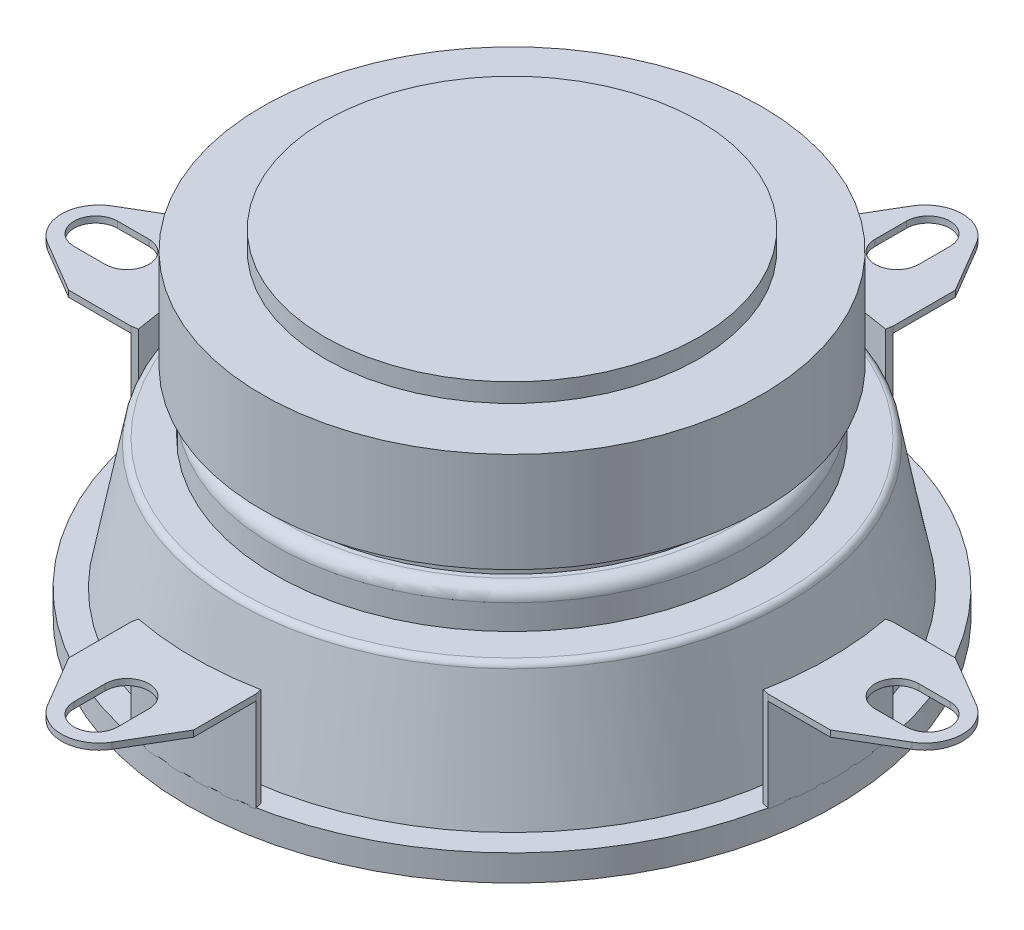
ISO-10303-21;
HEADER;
FILE_DESCRIPTION(('STEP AP214'),'2;1');
FILE_NAME('part.step','',(''),(''),'','','');
FILE_SCHEMA(('AUTOMOTIVE_DESIGN { 1 0 10303 214 1 1 1 1 }'));
ENDSEC;
DATA;
#1=APPLICATION_CONTEXT('core data for automotive mechanical design processes');
#2=APPLICATION_PROTOCOL_DEFINITION('international standard','automotive_design',2000,#1);
#3=PRODUCT_CONTEXT('',#1,'mechanical');
#4=PRODUCT('Part','Part','',(#3));
#5=PRODUCT_RELATED_PRODUCT_CATEGORY('part','',(#4));
#6=PRODUCT_DEFINITION_FORMATION('','',#4);
#7=PRODUCT_DEFINITION_CONTEXT('part definition',#1,'design');
#8=PRODUCT_DEFINITION('design','',#6,#7);
#9=PRODUCT_DEFINITION_SHAPE('','',#8);
#10=(LENGTH_UNIT() NAMED_UNIT(*) SI_UNIT(.MILLI.,.METRE.));
#11=(NAMED_UNIT(*) PLANE_ANGLE_UNIT() SI_UNIT($,.RADIAN.));
#12=(NAMED_UNIT(*) SI_UNIT($,.STERADIAN.) SOLID_ANGLE_UNIT());
#13=UNCERTAINTY_MEASURE_WITH_UNIT(LENGTH_MEASURE(1.E-05),#10,'distance_accuracy_value','');
#14=(GEOMETRIC_REPRESENTATION_CONTEXT(3) GLOBAL_UNCERTAINTY_ASSIGNED_CONTEXT((#13)) GLOBAL_UNIT_ASSIGNED_CONTEXT((#10,
#11,#12)) REPRESENTATION_CONTEXT('',''));
#15=CARTESIAN_POINT('',(0.,0.,0.));
#16=DIRECTION('',(0.,0.,1.));
#17=DIRECTION('',(1.,0.,0.));
#18=AXIS2_PLACEMENT_3D('',#15,#16,#17);
#19=CARTESIAN_POINT('',(25.5147016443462,9.5,-4.99999999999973));
#20=DIRECTION('',(0.,0.,-1.));
#21=DIRECTION('',(-1.,0.,0.));
#22=AXIS2_PLACEMENT_3D('',#19,#20,#21);
#23=PLANE('',#22);
#24=DIRECTION('',(-1.,0.,0.));
#25=VECTOR('',#24,1.);
#26=CARTESIAN_POINT('',(25.5147016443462,10.,-4.99999999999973));
#27=LINE('',#26,#25);
#28=CARTESIAN_POINT('',(30.5147016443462,10.,-4.99999999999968));
#29=VERTEX_POINT('',#28);
#30=CARTESIAN_POINT('',(25.5147016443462,10.,-4.99999999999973));
#31=VERTEX_POINT('',#30);
#32=EDGE_CURVE('E223',#29,#31,#27,.T.);
#33=ORIENTED_EDGE('',*,*,#32,.F.);
#34=DIRECTION('',(0.,1.,0.));
#35=VECTOR('',#34,1.);
#36=CARTESIAN_POINT('',(30.5147016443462,9.5,-4.99999999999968));
#37=LINE('',#36,#35);
#38=CARTESIAN_POINT('',(30.5147016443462,9.5,-4.99999999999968));
#39=VERTEX_POINT('',#38);
#40=EDGE_CURVE('E67',#39,#29,#37,.T.);
#41=ORIENTED_EDGE('',*,*,#40,.F.);
#42=DIRECTION('',(-1.,0.,0.));
#43=VECTOR('',#42,1.);
#44=CARTESIAN_POINT('',(25.5147016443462,9.5,-4.99999999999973));
#45=LINE('',#44,#43);
#46=CARTESIAN_POINT('',(25.5147016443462,9.5,-4.99999999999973));
#47=VERTEX_POINT('',#46);
#48=EDGE_CURVE('E235',#39,#47,#45,.T.);
#49=ORIENTED_EDGE('',*,*,#48,.T.);
#50=DIRECTION('',(0.,1.,0.));
#51=VECTOR('',#50,1.);
#52=CARTESIAN_POINT('',(25.5147016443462,9.5,-4.99999999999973));
#53=LINE('',#52,#51);
#54=EDGE_CURVE('E12',#47,#31,#53,.T.);
#55=ORIENTED_EDGE('',*,*,#54,.T.);
#56=EDGE_LOOP('',(#33,#41,#49,#55));
#57=FACE_BOUND('',#56,.T.);
#58=ADVANCED_FACE('F58',(#57),#23,.T.);
#59=CARTESIAN_POINT('',(30.5147016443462,9.5,-4.99999999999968));
#60=DIRECTION('',(0.507672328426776,0.,-0.861550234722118));
#61=DIRECTION('',(-0.861550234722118,0.,-0.507672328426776));
#62=AXIS2_PLACEMENT_3D('',#59,#60,#61);
#63=PLANE('',#62);
#64=DIRECTION('',(-0.861550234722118,0.,-0.507672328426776));
#65=VECTOR('',#64,1.);
#66=CARTESIAN_POINT('',(30.5147016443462,10.,-4.99999999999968));
#67=LINE('',#66,#65);
#68=CARTESIAN_POINT('',(34.6136935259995,10.,-2.584650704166));
#69=VERTEX_POINT('',#68);
#70=EDGE_CURVE('E246',#69,#29,#67,.T.);
#71=ORIENTED_EDGE('',*,*,#70,.F.);
#72=DIRECTION('',(0.,1.,0.));
#73=VECTOR('',#72,1.);
#74=CARTESIAN_POINT('',(34.6136935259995,9.5,-2.584650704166));
#75=LINE('',#74,#73);
#76=CARTESIAN_POINT('',(34.6136935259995,9.5,-2.584650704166));
#77=VERTEX_POINT('',#76);
#78=EDGE_CURVE('E252',#77,#69,#75,.T.);
#79=ORIENTED_EDGE('',*,*,#78,.F.);
#80=DIRECTION('',(-0.861550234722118,0.,-0.507672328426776));
#81=VECTOR('',#80,1.);
#82=CARTESIAN_POINT('',(30.5147016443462,9.5,-4.99999999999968));
#83=LINE('',#82,#81);
#84=EDGE_CURVE('E232',#77,#39,#83,.T.);
#85=ORIENTED_EDGE('',*,*,#84,.T.);
#86=ORIENTED_EDGE('',*,*,#40,.T.);
#87=EDGE_LOOP('',(#71,#79,#85,#86));
#88=FACE_BOUND('',#87,.T.);
#89=ADVANCED_FACE('F291',(#88),#63,.T.);
#90=CARTESIAN_POINT('',(33.0906765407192,9.5,3.42486470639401E-13));
#91=DIRECTION('',(0.,1.,0.));
#92=DIRECTION('',(1.,0.,0.));
#93=AXIS2_PLACEMENT_3D('',#90,#91,#92);
#94=CYLINDRICAL_SURFACE('',#93,3.);
#95=CARTESIAN_POINT('',(33.0906765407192,10.,3.42486470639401E-13));
#96=DIRECTION('',(0.,1.,0.));
#97=DIRECTION('',(1.,0.,0.));
#98=AXIS2_PLACEMENT_3D('',#95,#96,#97);
#99=CIRCLE('',#98,3.);
#100=CARTESIAN_POINT('',(34.6136935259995,10.,2.58465070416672));
#101=VERTEX_POINT('',#100);
#102=EDGE_CURVE('E243',#101,#69,#99,.T.);
#103=ORIENTED_EDGE('',*,*,#102,.F.);
#104=DIRECTION('',(0.,1.,0.));
#105=VECTOR('',#104,1.);
#106=CARTESIAN_POINT('',(34.6136935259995,9.5,2.58465070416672));
#107=LINE('',#106,#105);
#108=CARTESIAN_POINT('',(34.6136935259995,9.5,2.58465070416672));
#109=VERTEX_POINT('',#108);
#110=EDGE_CURVE('E254',#109,#101,#107,.T.);
#111=ORIENTED_EDGE('',*,*,#110,.F.);
#112=CARTESIAN_POINT('',(33.0906765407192,9.5,3.42486470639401E-13));
#113=DIRECTION('',(0.,1.,0.));
#114=DIRECTION('',(1.,0.,0.));
#115=AXIS2_PLACEMENT_3D('',#112,#113,#114);
#116=CIRCLE('',#115,3.);
#117=EDGE_CURVE('E229',#109,#77,#116,.T.);
#118=ORIENTED_EDGE('',*,*,#117,.T.);
#119=ORIENTED_EDGE('',*,*,#78,.T.);
#120=EDGE_LOOP('',(#103,#111,#118,#119));
#121=FACE_BOUND('',#120,.T.);
#122=ADVANCED_FACE('F295',(#121),#94,.T.);
#123=CARTESIAN_POINT('',(30.5147016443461,9.5,5.00000000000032));
#124=DIRECTION('',(0.507672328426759,0.,0.861550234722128));
#125=DIRECTION('',(0.861550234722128,0.,-0.507672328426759));
#126=AXIS2_PLACEMENT_3D('',#123,#124,#125);
#127=PLANE('',#126);
#128=DIRECTION('',(0.861550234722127,0.,-0.507672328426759));
#129=VECTOR('',#128,1.);
#130=CARTESIAN_POINT('',(30.5147016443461,10.,5.00000000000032));
#131=LINE('',#130,#129);
#132=CARTESIAN_POINT('',(30.5147016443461,10.,5.00000000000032));
#133=VERTEX_POINT('',#132);
#134=EDGE_CURVE('E240',#133,#101,#131,.T.);
#135=ORIENTED_EDGE('',*,*,#134,.F.);
#136=DIRECTION('',(0.,1.,0.));
#137=VECTOR('',#136,1.);
#138=CARTESIAN_POINT('',(30.5147016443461,9.5,5.00000000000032));
#139=LINE('',#138,#137);
#140=CARTESIAN_POINT('',(30.5147016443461,9.5,5.00000000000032));
#141=VERTEX_POINT('',#140);
#142=EDGE_CURVE('E255',#141,#133,#139,.T.);
#143=ORIENTED_EDGE('',*,*,#142,.F.);
#144=DIRECTION('',(0.861550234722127,0.,-0.507672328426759));
#145=VECTOR('',#144,1.);
#146=CARTESIAN_POINT('',(30.5147016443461,9.5,5.00000000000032));
#147=LINE('',#146,#145);
#148=EDGE_CURVE('E226',#141,#109,#147,.T.);
#149=ORIENTED_EDGE('',*,*,#148,.T.);
#150=ORIENTED_EDGE('',*,*,#110,.T.);
#151=EDGE_LOOP('',(#135,#143,#149,#150));
#152=FACE_BOUND('',#151,.T.);
#153=ADVANCED_FACE('F297',(#152),#127,.T.);
#154=CARTESIAN_POINT('',(25.5147016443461,9.5,5.00000000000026));
#155=DIRECTION('',(0.,0.,1.));
#156=DIRECTION('',(1.,0.,0.));
#157=AXIS2_PLACEMENT_3D('',#154,#155,#156);
#158=PLANE('',#157);
#159=DIRECTION('',(1.,0.,0.));
#160=VECTOR('',#159,1.);
#161=CARTESIAN_POINT('',(25.5147016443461,10.,5.00000000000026));
#162=LINE('',#161,#160);
#163=CARTESIAN_POINT('',(25.5147016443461,10.,5.00000000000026));
#164=VERTEX_POINT('',#163);
#165=EDGE_CURVE('E211',#164,#133,#162,.T.);
#166=ORIENTED_EDGE('',*,*,#165,.F.);
#167=DIRECTION('',(0.,1.,0.));
#168=VECTOR('',#167,1.);
#169=CARTESIAN_POINT('',(25.5147016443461,9.5,5.00000000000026));
#170=LINE('',#169,#168);
#171=CARTESIAN_POINT('',(25.5147016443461,9.5,5.00000000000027));
#172=VERTEX_POINT('',#171);
#173=EDGE_CURVE('E62',#172,#164,#170,.T.);
#174=ORIENTED_EDGE('',*,*,#173,.F.);
#175=DIRECTION('',(1.,0.,0.));
#176=VECTOR('',#175,1.);
#177=CARTESIAN_POINT('',(25.5147016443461,9.5,5.00000000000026));
#178=LINE('',#177,#176);
#179=EDGE_CURVE('E222',#172,#141,#178,.T.);
#180=ORIENTED_EDGE('',*,*,#179,.T.);
#181=ORIENTED_EDGE('',*,*,#142,.T.);
#182=EDGE_LOOP('',(#166,#174,#180,#181));
#183=FACE_BOUND('',#182,.T.);
#184=ADVANCED_FACE('F60',(#183),#158,.T.);
#185=CARTESIAN_POINT('',(0.,9.5,0.));
#186=DIRECTION('',(0.,1.,0.));
#187=DIRECTION('',(1.,0.,0.));
#188=AXIS2_PLACEMENT_3D('',#185,#186,#187);
#189=PLANE('',#188);
#190=DIRECTION('',(-1.,0.,0.));
#191=VECTOR('',#190,1.);
#192=CARTESIAN_POINT('',(0.,9.5,-1.75));
#193=LINE('',#192,#191);
#194=CARTESIAN_POINT('',(33.3406765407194,9.5,-1.74999999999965));
#195=VERTEX_POINT('',#194);
#196=CARTESIAN_POINT('',(30.8406765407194,9.5,-1.74999999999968));
#197=VERTEX_POINT('',#196);
#198=EDGE_CURVE('E186',#195,#197,#193,.T.);
#199=ORIENTED_EDGE('',*,*,#198,.T.);
#200=CARTESIAN_POINT('',(30.8406765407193,9.5,3.23038939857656E-13));
#201=DIRECTION('',(0.,1.,0.));
#202=DIRECTION('',(1.,0.,0.));
#203=AXIS2_PLACEMENT_3D('',#200,#201,#202);
#204=CIRCLE('',#203,1.75);
#205=CARTESIAN_POINT('',(30.8406765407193,9.5,1.75000000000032));
#206=VERTEX_POINT('',#205);
#207=EDGE_CURVE('E189',#197,#206,#204,.T.);
#208=ORIENTED_EDGE('',*,*,#207,.T.);
#209=DIRECTION('',(1.,0.,0.));
#210=VECTOR('',#209,1.);
#211=CARTESIAN_POINT('',(0.,9.5,1.75));
#212=LINE('',#211,#210);
#213=CARTESIAN_POINT('',(33.3406765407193,9.5,1.75000000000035));
#214=VERTEX_POINT('',#213);
#215=EDGE_CURVE('E181',#206,#214,#212,.T.);
#216=ORIENTED_EDGE('',*,*,#215,.T.);
#217=CARTESIAN_POINT('',(33.3406765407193,9.5,3.4922504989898E-13));
#218=DIRECTION('',(0.,1.,0.));
#219=DIRECTION('',(1.,0.,0.));
#220=AXIS2_PLACEMENT_3D('',#217,#218,#219);
#221=CIRCLE('',#220,1.75);
#222=EDGE_CURVE('E161',#214,#195,#221,.T.);
#223=ORIENTED_EDGE('',*,*,#222,.T.);
#224=EDGE_LOOP('',(#199,#208,#216,#223));
#225=FACE_BOUND('',#224,.T.);
#226=CARTESIAN_POINT('',(0.,9.5,0.));
#227=DIRECTION('',(0.,-1.,0.));
#228=DIRECTION('',(1.,0.,0.));
#229=AXIS2_PLACEMENT_3D('',#226,#227,#228);
#230=CIRCLE('',#229,26.);
#231=EDGE_CURVE('E220',#47,#172,#230,.T.);
#232=ORIENTED_EDGE('',*,*,#231,.F.);
#233=ORIENTED_EDGE('',*,*,#48,.F.);
#234=ORIENTED_EDGE('',*,*,#84,.F.);
#235=ORIENTED_EDGE('',*,*,#117,.F.);
#236=ORIENTED_EDGE('',*,*,#148,.F.);
#237=ORIENTED_EDGE('',*,*,#179,.F.);
#238=EDGE_LOOP('',(#232,#233,#234,#235,#236,#237));
#239=FACE_BOUND('',#238,.T.);
#240=ADVANCED_FACE('F284',(#225,#239),#189,.F.);
#241=CARTESIAN_POINT('',(0.,10.,0.));
#242=DIRECTION('',(0.,1.,0.));
#243=DIRECTION('',(1.,0.,0.));
#244=AXIS2_PLACEMENT_3D('',#241,#242,#243);
#245=PLANE('',#244);
#246=CARTESIAN_POINT('',(30.8406765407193,10.,3.23038939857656E-13));
#247=DIRECTION('',(0.,1.,0.));
#248=DIRECTION('',(1.,0.,0.));
#249=AXIS2_PLACEMENT_3D('',#246,#247,#248);
#250=CIRCLE('',#249,1.75);
#251=CARTESIAN_POINT('',(30.8406765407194,10.,-1.74999999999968));
#252=VERTEX_POINT('',#251);
#253=CARTESIAN_POINT('',(30.8406765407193,10.,1.75000000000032));
#254=VERTEX_POINT('',#253);
#255=EDGE_CURVE('E83',#252,#254,#250,.T.);
#256=ORIENTED_EDGE('',*,*,#255,.F.);
#257=DIRECTION('',(-1.,0.,0.));
#258=VECTOR('',#257,1.);
#259=CARTESIAN_POINT('',(30.8406765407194,10.,-1.74999999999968));
#260=LINE('',#259,#258);
#261=CARTESIAN_POINT('',(33.3406765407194,10.,-1.74999999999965));
#262=VERTEX_POINT('',#261);
#263=EDGE_CURVE('E174',#262,#252,#260,.T.);
#264=ORIENTED_EDGE('',*,*,#263,.F.);
#265=CARTESIAN_POINT('',(33.3406765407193,10.,3.4922504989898E-13));
#266=DIRECTION('',(0.,1.,0.));
#267=DIRECTION('',(1.,0.,0.));
#268=AXIS2_PLACEMENT_3D('',#265,#266,#267);
#269=CIRCLE('',#268,1.75);
#270=CARTESIAN_POINT('',(33.3406765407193,10.,1.75000000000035));
#271=VERTEX_POINT('',#270);
#272=EDGE_CURVE('E158',#271,#262,#269,.T.);
#273=ORIENTED_EDGE('',*,*,#272,.F.);
#274=DIRECTION('',(1.,0.,0.));
#275=VECTOR('',#274,1.);
#276=CARTESIAN_POINT('',(30.8406765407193,10.,1.75000000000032));
#277=LINE('',#276,#275);
#278=EDGE_CURVE('E167',#254,#271,#277,.T.);
#279=ORIENTED_EDGE('',*,*,#278,.F.);
#280=EDGE_LOOP('',(#256,#264,#273,#279));
#281=FACE_BOUND('',#280,.T.);
#282=ORIENTED_EDGE('',*,*,#32,.T.);
#283=DIRECTION('',(0.981334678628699,0.,-0.192307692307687));
#284=VECTOR('',#283,1.);
#285=CARTESIAN_POINT('',(25.0240343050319,10.,-4.90384615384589));
#286=LINE('',#285,#284);
#287=CARTESIAN_POINT('',(25.0240343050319,10.,-4.90384615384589));
#288=VERTEX_POINT('',#287);
#289=EDGE_CURVE('E192',#288,#31,#286,.T.);
#290=ORIENTED_EDGE('',*,*,#289,.F.);
#291=CARTESIAN_POINT('',(0.,10.,0.));
#292=DIRECTION('',(0.,1.,0.));
#293=DIRECTION('',(0.,0.,1.));
#294=AXIS2_PLACEMENT_3D('',#291,#292,#293);
#295=CIRCLE('',#294,25.5);
#296=CARTESIAN_POINT('',(25.0240343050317,10.,4.90384615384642));
#297=VERTEX_POINT('',#296);
#298=EDGE_CURVE('E205',#297,#288,#295,.T.);
#299=ORIENTED_EDGE('',*,*,#298,.F.);
#300=DIRECTION('',(-0.981334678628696,0.,-0.192307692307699));
#301=VECTOR('',#300,1.);
#302=CARTESIAN_POINT('',(25.5147016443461,10.,5.00000000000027));
#303=LINE('',#302,#301);
#304=EDGE_CURVE('E197',#164,#297,#303,.T.);
#305=ORIENTED_EDGE('',*,*,#304,.F.);
#306=ORIENTED_EDGE('',*,*,#165,.T.);
#307=ORIENTED_EDGE('',*,*,#134,.T.);
#308=ORIENTED_EDGE('',*,*,#102,.T.);
#309=ORIENTED_EDGE('',*,*,#70,.T.);
#310=EDGE_LOOP('',(#282,#290,#299,#305,#306,#307,#308,#309));
#311=FACE_BOUND('',#310,.T.);
#312=ADVANCED_FACE('F171',(#281,#311),#245,.T.);
#313=CARTESIAN_POINT('',(0.,2.,0.));
#314=DIRECTION('',(0.,1.,0.));
#315=DIRECTION('',(1.,0.,0.));
#316=AXIS2_PLACEMENT_3D('',#313,#314,#315);
#317=CYLINDRICAL_SURFACE('',#316,26.);
#318=ORIENTED_EDGE('',*,*,#231,.T.);
#319=DIRECTION('',(0.,1.,0.));
#320=VECTOR('',#319,1.);
#321=CARTESIAN_POINT('',(25.5147016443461,2.,5.00000000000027));
#322=LINE('',#321,#320);
#323=CARTESIAN_POINT('',(25.5147016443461,2.,5.00000000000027));
#324=VERTEX_POINT('',#323);
#325=EDGE_CURVE('E208',#324,#172,#322,.T.);
#326=ORIENTED_EDGE('',*,*,#325,.F.);
#327=CARTESIAN_POINT('',(0.,2.,0.));
#328=DIRECTION('',(0.,1.,0.));
#329=DIRECTION('',(1.,0.,0.));
#330=AXIS2_PLACEMENT_3D('',#327,#328,#329);
#331=CIRCLE('',#330,26.);
#332=CARTESIAN_POINT('',(25.5147016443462,2.,-4.99999999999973));
#333=VERTEX_POINT('',#332);
#334=EDGE_CURVE('E193',#324,#333,#331,.T.);
#335=ORIENTED_EDGE('',*,*,#334,.T.);
#336=DIRECTION('',(0.,1.,0.));
#337=VECTOR('',#336,1.);
#338=CARTESIAN_POINT('',(25.5147016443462,2.,-4.99999999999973));
#339=LINE('',#338,#337);
#340=EDGE_CURVE('E203',#333,#47,#339,.T.);
#341=ORIENTED_EDGE('',*,*,#340,.T.);
#342=EDGE_LOOP('',(#318,#326,#335,#341));
#343=FACE_BOUND('',#342,.T.);
#344=ADVANCED_FACE('F280',(#343),#317,.T.);
#345=CARTESIAN_POINT('',(25.5147016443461,2.,5.00000000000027));
#346=DIRECTION('',(0.192307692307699,0.,-0.981334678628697));
#347=DIRECTION('',(-0.981334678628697,0.,-0.192307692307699));
#348=AXIS2_PLACEMENT_3D('',#345,#346,#347);
#349=PLANE('',#348);
#350=ORIENTED_EDGE('',*,*,#304,.T.);
#351=DIRECTION('',(0.,1.,0.));
#352=VECTOR('',#351,1.);
#353=CARTESIAN_POINT('',(25.0240343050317,2.,4.90384615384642));
#354=LINE('',#353,#352);
#355=CARTESIAN_POINT('',(25.0240343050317,2.,4.90384615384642));
#356=VERTEX_POINT('',#355);
#357=EDGE_CURVE('E212',#356,#297,#354,.T.);
#358=ORIENTED_EDGE('',*,*,#357,.F.);
#359=DIRECTION('',(-0.981334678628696,0.,-0.192307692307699));
#360=VECTOR('',#359,1.);
#361=CARTESIAN_POINT('',(25.5147016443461,2.,5.00000000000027));
#362=LINE('',#361,#360);
#363=EDGE_CURVE('E201',#324,#356,#362,.T.);
#364=ORIENTED_EDGE('',*,*,#363,.F.);
#365=ORIENTED_EDGE('',*,*,#325,.T.);
#366=ORIENTED_EDGE('',*,*,#173,.T.);
#367=EDGE_LOOP('',(#350,#358,#364,#365,#366));
#368=FACE_BOUND('',#367,.T.);
#369=ADVANCED_FACE('F262',(#368),#349,.F.);
#370=CARTESIAN_POINT('',(0.,2.,0.));
#371=DIRECTION('',(0.,1.,0.));
#372=DIRECTION('',(1.,0.,0.));
#373=AXIS2_PLACEMENT_3D('',#370,#371,#372);
#374=CYLINDRICAL_SURFACE('',#373,25.5);
#375=ORIENTED_EDGE('',*,*,#298,.T.);
#376=DIRECTION('',(0.,1.,0.));
#377=VECTOR('',#376,1.);
#378=CARTESIAN_POINT('',(25.0240343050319,2.,-4.90384615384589));
#379=LINE('',#378,#377);
#380=CARTESIAN_POINT('',(25.0240343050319,2.,-4.90384615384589));
#381=VERTEX_POINT('',#380);
#382=EDGE_CURVE('E215',#381,#288,#379,.T.);
#383=ORIENTED_EDGE('',*,*,#382,.F.);
#384=CARTESIAN_POINT('',(0.,2.,0.));
#385=DIRECTION('',(0.,1.,0.));
#386=DIRECTION('',(0.,0.,1.));
#387=AXIS2_PLACEMENT_3D('',#384,#385,#386);
#388=CIRCLE('',#387,25.5);
#389=EDGE_CURVE('E199',#356,#381,#388,.T.);
#390=ORIENTED_EDGE('',*,*,#389,.F.);
#391=ORIENTED_EDGE('',*,*,#357,.T.);
#392=EDGE_LOOP('',(#375,#383,#390,#391));
#393=FACE_BOUND('',#392,.T.);
#394=ADVANCED_FACE('F270',(#393),#374,.F.);
#395=CARTESIAN_POINT('',(25.0240343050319,2.,-4.90384615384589));
#396=DIRECTION('',(0.192307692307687,0.,0.981334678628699));
#397=DIRECTION('',(0.981334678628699,0.,-0.192307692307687));
#398=AXIS2_PLACEMENT_3D('',#395,#396,#397);
#399=PLANE('',#398);
#400=ORIENTED_EDGE('',*,*,#289,.T.);
#401=ORIENTED_EDGE('',*,*,#54,.F.);
#402=ORIENTED_EDGE('',*,*,#340,.F.);
#403=DIRECTION('',(0.981334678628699,0.,-0.192307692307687));
#404=VECTOR('',#403,1.);
#405=CARTESIAN_POINT('',(25.0240343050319,2.,-4.90384615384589));
#406=LINE('',#405,#404);
#407=EDGE_CURVE('E196',#381,#333,#406,.T.);
#408=ORIENTED_EDGE('',*,*,#407,.F.);
#409=ORIENTED_EDGE('',*,*,#382,.T.);
#410=EDGE_LOOP('',(#400,#401,#402,#408,#409));
#411=FACE_BOUND('',#410,.T.);
#412=ADVANCED_FACE('F274',(#411),#399,.F.);
#413=CARTESIAN_POINT('',(0.,2.,0.));
#414=DIRECTION('',(0.,1.,0.));
#415=DIRECTION('',(0.,0.,1.));
#416=AXIS2_PLACEMENT_3D('',#413,#414,#415);
#417=PLANE('',#416);
#418=ORIENTED_EDGE('',*,*,#334,.F.);
#419=ORIENTED_EDGE('',*,*,#363,.T.);
#420=ORIENTED_EDGE('',*,*,#389,.T.);
#421=ORIENTED_EDGE('',*,*,#407,.T.);
#422=EDGE_LOOP('',(#418,#419,#420,#421));
#423=FACE_BOUND('',#422,.T.);
#424=ADVANCED_FACE('F278',(#423),#417,.F.);
#425=CARTESIAN_POINT('',(30.8406765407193,1.,3.23038939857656E-13));
#426=DIRECTION('',(0.,1.,0.));
#427=DIRECTION('',(1.,0.,0.));
#428=AXIS2_PLACEMENT_3D('',#425,#426,#427);
#429=CYLINDRICAL_SURFACE('',#428,1.75);
#430=DIRECTION('',(0.,1.,0.));
#431=VECTOR('',#430,1.);
#432=CARTESIAN_POINT('',(30.8406765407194,1.,-1.74999999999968));
#433=LINE('',#432,#431);
#434=EDGE_CURVE('E179',#197,#252,#433,.T.);
#435=ORIENTED_EDGE('',*,*,#434,.T.);
#436=ORIENTED_EDGE('',*,*,#255,.T.);
#437=DIRECTION('',(0.,1.,0.));
#438=VECTOR('',#437,1.);
#439=CARTESIAN_POINT('',(30.8406765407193,1.,1.75000000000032));
#440=LINE('',#439,#438);
#441=EDGE_CURVE('E164',#206,#254,#440,.T.);
#442=ORIENTED_EDGE('',*,*,#441,.F.);
#443=ORIENTED_EDGE('',*,*,#207,.F.);
#444=EDGE_LOOP('',(#435,#436,#442,#443));
#445=FACE_BOUND('',#444,.T.);
#446=ADVANCED_FACE('F326',(#445),#429,.F.);
#447=CARTESIAN_POINT('',(30.8406765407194,1.,-1.74999999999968));
#448=DIRECTION('',(0.,0.,-1.));
#449=DIRECTION('',(-1.,0.,0.));
#450=AXIS2_PLACEMENT_3D('',#447,#448,#449);
#451=PLANE('',#450);
#452=DIRECTION('',(0.,1.,0.));
#453=VECTOR('',#452,1.);
#454=CARTESIAN_POINT('',(33.3406765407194,1.,-1.74999999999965));
#455=LINE('',#454,#453);
#456=EDGE_CURVE('E163',#195,#262,#455,.T.);
#457=ORIENTED_EDGE('',*,*,#456,.T.);
#458=ORIENTED_EDGE('',*,*,#263,.T.);
#459=ORIENTED_EDGE('',*,*,#434,.F.);
#460=ORIENTED_EDGE('',*,*,#198,.F.);
#461=EDGE_LOOP('',(#457,#458,#459,#460));
#462=FACE_BOUND('',#461,.T.);
#463=ADVANCED_FACE('F329',(#462),#451,.F.);
#464=CARTESIAN_POINT('',(33.3406765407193,1.,3.4922504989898E-13));
#465=DIRECTION('',(0.,1.,0.));
#466=DIRECTION('',(1.,0.,0.));
#467=AXIS2_PLACEMENT_3D('',#464,#465,#466);
#468=CYLINDRICAL_SURFACE('',#467,1.75);
#469=DIRECTION('',(0.,1.,0.));
#470=VECTOR('',#469,1.);
#471=CARTESIAN_POINT('',(33.3406765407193,1.,1.75000000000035));
#472=LINE('',#471,#470);
#473=EDGE_CURVE('E75',#214,#271,#472,.T.);
#474=ORIENTED_EDGE('',*,*,#473,.T.);
#475=ORIENTED_EDGE('',*,*,#272,.T.);
#476=ORIENTED_EDGE('',*,*,#456,.F.);
#477=ORIENTED_EDGE('',*,*,#222,.F.);
#478=EDGE_LOOP('',(#474,#475,#476,#477));
#479=FACE_BOUND('',#478,.T.);
#480=ADVANCED_FACE('F155',(#479),#468,.F.);
#481=CARTESIAN_POINT('',(30.8406765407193,1.,1.75000000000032));
#482=DIRECTION('',(0.,0.,1.));
#483=DIRECTION('',(1.,0.,0.));
#484=AXIS2_PLACEMENT_3D('',#481,#482,#483);
#485=PLANE('',#484);
#486=ORIENTED_EDGE('',*,*,#441,.T.);
#487=ORIENTED_EDGE('',*,*,#278,.T.);
#488=ORIENTED_EDGE('',*,*,#473,.F.);
#489=ORIENTED_EDGE('',*,*,#215,.F.);
#490=EDGE_LOOP('',(#486,#487,#488,#489));
#491=FACE_BOUND('',#490,.T.);
#492=ADVANCED_FACE('F168',(#491),#485,.F.);
#493=CLOSED_SHELL('',(#58,#89,#122,#153,#184,#240,#312,#344,#369,#394,#412,#424,#446,#463,#480,#492));
#494=MANIFOLD_SOLID_BREP('B2',#493);
#495=CARTESIAN_POINT('',(-5.,9.5,-25.5147016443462));
#496=DIRECTION('',(-1.,0.,0.));
#497=DIRECTION('',(0.,0.,1.));
#498=AXIS2_PLACEMENT_3D('',#495,#496,#497);
#499=PLANE('',#498);
#500=DIRECTION('',(0.,0.,1.));
#501=VECTOR('',#500,1.);
#502=CARTESIAN_POINT('',(-5.,10.,-25.5147016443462));
#503=LINE('',#502,#501);
#504=CARTESIAN_POINT('',(-5.,10.,-30.5147016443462));
#505=VERTEX_POINT('',#504);
#506=CARTESIAN_POINT('',(-5.,10.,-25.5147016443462));
#507=VERTEX_POINT('',#506);
#508=EDGE_CURVE('E706',#505,#507,#503,.T.);
#509=ORIENTED_EDGE('',*,*,#508,.F.);
#510=DIRECTION('',(0.,1.,0.));
#511=VECTOR('',#510,1.);
#512=CARTESIAN_POINT('',(-5.,9.5,-30.5147016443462));
#513=LINE('',#512,#511);
#514=CARTESIAN_POINT('',(-5.,9.5,-30.5147016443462));
#515=VERTEX_POINT('',#514);
#516=EDGE_CURVE('E550',#515,#505,#513,.T.);
#517=ORIENTED_EDGE('',*,*,#516,.F.);
#518=DIRECTION('',(0.,0.,1.));
#519=VECTOR('',#518,1.);
#520=CARTESIAN_POINT('',(-5.,9.5,-25.5147016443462));
#521=LINE('',#520,#519);
#522=CARTESIAN_POINT('',(-5.,9.5,-25.5147016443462));
#523=VERTEX_POINT('',#522);
#524=EDGE_CURVE('E718',#515,#523,#521,.T.);
#525=ORIENTED_EDGE('',*,*,#524,.T.);
#526=DIRECTION('',(0.,1.,0.));
#527=VECTOR('',#526,1.);
#528=CARTESIAN_POINT('',(-5.,9.5,-25.5147016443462));
#529=LINE('',#528,#527);
#530=EDGE_CURVE('E56',#523,#507,#529,.T.);
#531=ORIENTED_EDGE('',*,*,#530,.T.);
#532=EDGE_LOOP('',(#509,#517,#525,#531));
#533=FACE_BOUND('',#532,.T.);
#534=ADVANCED_FACE('F541',(#533),#499,.T.);
#535=CARTESIAN_POINT('',(-5.,9.5,-30.5147016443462));
#536=DIRECTION('',(-0.861550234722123,0.,-0.507672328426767));
#537=DIRECTION('',(-0.507672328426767,0.,0.861550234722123));
#538=AXIS2_PLACEMENT_3D('',#535,#536,#537);
#539=PLANE('',#538);
#540=DIRECTION('',(-0.507672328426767,0.,0.861550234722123));
#541=VECTOR('',#540,1.);
#542=CARTESIAN_POINT('',(-5.,10.,-30.5147016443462));
#543=LINE('',#542,#541);
#544=CARTESIAN_POINT('',(-2.58465070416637,10.,-34.6136935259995));
#545=VERTEX_POINT('',#544);
#546=EDGE_CURVE('E729',#545,#505,#543,.T.);
#547=ORIENTED_EDGE('',*,*,#546,.F.);
#548=DIRECTION('',(0.,1.,0.));
#549=VECTOR('',#548,1.);
#550=CARTESIAN_POINT('',(-2.58465070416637,9.5,-34.6136935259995));
#551=LINE('',#550,#549);
#552=CARTESIAN_POINT('',(-2.58465070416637,9.5,-34.6136935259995));
#553=VERTEX_POINT('',#552);
#554=EDGE_CURVE('E735',#553,#545,#551,.T.);
#555=ORIENTED_EDGE('',*,*,#554,.F.);
#556=DIRECTION('',(-0.507672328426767,0.,0.861550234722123));
#557=VECTOR('',#556,1.);
#558=CARTESIAN_POINT('',(-5.,9.5,-30.5147016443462));
#559=LINE('',#558,#557);
#560=EDGE_CURVE('E715',#553,#515,#559,.T.);
#561=ORIENTED_EDGE('',*,*,#560,.T.);
#562=ORIENTED_EDGE('',*,*,#516,.T.);
#563=EDGE_LOOP('',(#547,#555,#561,#562));
#564=FACE_BOUND('',#563,.T.);
#565=ADVANCED_FACE('F774',(#564),#539,.T.);
#566=CARTESIAN_POINT('',(0.,9.5,-33.0906765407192));
#567=DIRECTION('',(0.,1.,0.));
#568=DIRECTION('',(0.,0.,-1.));
#569=AXIS2_PLACEMENT_3D('',#566,#567,#568);
#570=CYLINDRICAL_SURFACE('',#569,3.);
#571=CARTESIAN_POINT('',(0.,10.,-33.0906765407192));
#572=DIRECTION('',(0.,1.,0.));
#573=DIRECTION('',(0.,0.,-1.));
#574=AXIS2_PLACEMENT_3D('',#571,#572,#573);
#575=CIRCLE('',#574,3.);
#576=CARTESIAN_POINT('',(2.58465070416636,10.,-34.6136935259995));
#577=VERTEX_POINT('',#576);
#578=EDGE_CURVE('E726',#577,#545,#575,.T.);
#579=ORIENTED_EDGE('',*,*,#578,.F.);
#580=DIRECTION('',(0.,1.,0.));
#581=VECTOR('',#580,1.);
#582=CARTESIAN_POINT('',(2.58465070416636,9.5,-34.6136935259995));
#583=LINE('',#582,#581);
#584=CARTESIAN_POINT('',(2.58465070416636,9.5,-34.6136935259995));
#585=VERTEX_POINT('',#584);
#586=EDGE_CURVE('E737',#585,#577,#583,.T.);
#587=ORIENTED_EDGE('',*,*,#586,.F.);
#588=CARTESIAN_POINT('',(0.,9.5,-33.0906765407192));
#589=DIRECTION('',(0.,1.,0.));
#590=DIRECTION('',(0.,0.,-1.));
#591=AXIS2_PLACEMENT_3D('',#588,#589,#590);
#592=CIRCLE('',#591,3.);
#593=EDGE_CURVE('E712',#585,#553,#592,.T.);
#594=ORIENTED_EDGE('',*,*,#593,.T.);
#595=ORIENTED_EDGE('',*,*,#554,.T.);
#596=EDGE_LOOP('',(#579,#587,#594,#595));
#597=FACE_BOUND('',#596,.T.);
#598=ADVANCED_FACE('F778',(#597),#570,.T.);
#599=CARTESIAN_POINT('',(5.,9.5,-30.5147016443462));
#600=DIRECTION('',(0.861550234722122,0.,-0.507672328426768));
#601=DIRECTION('',(-0.507672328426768,0.,-0.861550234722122));
#602=AXIS2_PLACEMENT_3D('',#599,#600,#601);
#603=PLANE('',#602);
#604=DIRECTION('',(-0.507672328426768,0.,-0.861550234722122));
#605=VECTOR('',#604,1.);
#606=CARTESIAN_POINT('',(5.,10.,-30.5147016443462));
#607=LINE('',#606,#605);
#608=CARTESIAN_POINT('',(5.,10.,-30.5147016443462));
#609=VERTEX_POINT('',#608);
#610=EDGE_CURVE('E723',#609,#577,#607,.T.);
#611=ORIENTED_EDGE('',*,*,#610,.F.);
#612=DIRECTION('',(0.,1.,0.));
#613=VECTOR('',#612,1.);
#614=CARTESIAN_POINT('',(5.,9.5,-30.5147016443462));
#615=LINE('',#614,#613);
#616=CARTESIAN_POINT('',(5.,9.5,-30.5147016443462));
#617=VERTEX_POINT('',#616);
#618=EDGE_CURVE('E738',#617,#609,#615,.T.);
#619=ORIENTED_EDGE('',*,*,#618,.F.);
#620=DIRECTION('',(-0.507672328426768,0.,-0.861550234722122));
#621=VECTOR('',#620,1.);
#622=CARTESIAN_POINT('',(5.,9.5,-30.5147016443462));
#623=LINE('',#622,#621);
#624=EDGE_CURVE('E709',#617,#585,#623,.T.);
#625=ORIENTED_EDGE('',*,*,#624,.T.);
#626=ORIENTED_EDGE('',*,*,#586,.T.);
#627=EDGE_LOOP('',(#611,#619,#625,#626));
#628=FACE_BOUND('',#627,.T.);
#629=ADVANCED_FACE('F780',(#628),#603,.T.);
#630=CARTESIAN_POINT('',(5.,9.5,-25.5147016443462));
#631=DIRECTION('',(1.,0.,0.));
#632=DIRECTION('',(0.,0.,-1.));
#633=AXIS2_PLACEMENT_3D('',#630,#631,#632);
#634=PLANE('',#633);
#635=DIRECTION('',(0.,0.,-1.));
#636=VECTOR('',#635,1.);
#637=CARTESIAN_POINT('',(5.,10.,-25.5147016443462));
#638=LINE('',#637,#636);
#639=CARTESIAN_POINT('',(5.,10.,-25.5147016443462));
#640=VERTEX_POINT('',#639);
#641=EDGE_CURVE('E694',#640,#609,#638,.T.);
#642=ORIENTED_EDGE('',*,*,#641,.F.);
#643=DIRECTION('',(0.,1.,0.));
#644=VECTOR('',#643,1.);
#645=CARTESIAN_POINT('',(5.,9.5,-25.5147016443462));
#646=LINE('',#645,#644);
#647=CARTESIAN_POINT('',(5.,9.5,-25.5147016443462));
#648=VERTEX_POINT('',#647);
#649=EDGE_CURVE('E545',#648,#640,#646,.T.);
#650=ORIENTED_EDGE('',*,*,#649,.F.);
#651=DIRECTION('',(0.,0.,-1.));
#652=VECTOR('',#651,1.);
#653=CARTESIAN_POINT('',(5.,9.5,-25.5147016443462));
#654=LINE('',#653,#652);
#655=EDGE_CURVE('E705',#648,#617,#654,.T.);
#656=ORIENTED_EDGE('',*,*,#655,.T.);
#657=ORIENTED_EDGE('',*,*,#618,.T.);
#658=EDGE_LOOP('',(#642,#650,#656,#657));
#659=FACE_BOUND('',#658,.T.);
#660=ADVANCED_FACE('F543',(#659),#634,.T.);
#661=CARTESIAN_POINT('',(0.,9.5,0.));
#662=DIRECTION('',(0.,1.,0.));
#663=DIRECTION('',(0.,0.,-1.));
#664=AXIS2_PLACEMENT_3D('',#661,#662,#663);
#665=PLANE('',#664);
#666=DIRECTION('',(0.,0.,1.));
#667=VECTOR('',#666,1.);
#668=CARTESIAN_POINT('',(-1.75,9.5,0.));
#669=LINE('',#668,#667);
#670=CARTESIAN_POINT('',(-1.75,9.5,-33.3406765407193));
#671=VERTEX_POINT('',#670);
#672=CARTESIAN_POINT('',(-1.75,9.5,-30.8406765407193));
#673=VERTEX_POINT('',#672);
#674=EDGE_CURVE('E669',#671,#673,#669,.T.);
#675=ORIENTED_EDGE('',*,*,#674,.T.);
#676=CARTESIAN_POINT('',(0.,9.5,-30.8406765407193));
#677=DIRECTION('',(0.,1.,0.));
#678=DIRECTION('',(0.,0.,-1.));
#679=AXIS2_PLACEMENT_3D('',#676,#677,#678);
#680=CIRCLE('',#679,1.75);
#681=CARTESIAN_POINT('',(1.75,9.5,-30.8406765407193));
#682=VERTEX_POINT('',#681);
#683=EDGE_CURVE('E672',#673,#682,#680,.T.);
#684=ORIENTED_EDGE('',*,*,#683,.T.);
#685=DIRECTION('',(0.,0.,-1.));
#686=VECTOR('',#685,1.);
#687=CARTESIAN_POINT('',(1.75,9.5,0.));
#688=LINE('',#687,#686);
#689=CARTESIAN_POINT('',(1.75,9.5,-33.3406765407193));
#690=VERTEX_POINT('',#689);
#691=EDGE_CURVE('E664',#682,#690,#688,.T.);
#692=ORIENTED_EDGE('',*,*,#691,.T.);
#693=CARTESIAN_POINT('',(0.,9.5,-33.3406765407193));
#694=DIRECTION('',(0.,1.,0.));
#695=DIRECTION('',(0.,0.,-1.));
#696=AXIS2_PLACEMENT_3D('',#693,#694,#695);
#697=CIRCLE('',#696,1.75);
#698=EDGE_CURVE('E644',#690,#671,#697,.T.);
#699=ORIENTED_EDGE('',*,*,#698,.T.);
#700=EDGE_LOOP('',(#675,#684,#692,#699));
#701=FACE_BOUND('',#700,.T.);
#702=CARTESIAN_POINT('',(0.,9.5,0.));
#703=DIRECTION('',(0.,-1.,0.));
#704=DIRECTION('',(0.,0.,-1.));
#705=AXIS2_PLACEMENT_3D('',#702,#703,#704);
#706=CIRCLE('',#705,26.);
#707=EDGE_CURVE('E703',#523,#648,#706,.T.);
#708=ORIENTED_EDGE('',*,*,#707,.F.);
#709=ORIENTED_EDGE('',*,*,#524,.F.);
#710=ORIENTED_EDGE('',*,*,#560,.F.);
#711=ORIENTED_EDGE('',*,*,#593,.F.);
#712=ORIENTED_EDGE('',*,*,#624,.F.);
#713=ORIENTED_EDGE('',*,*,#655,.F.);
#714=EDGE_LOOP('',(#708,#709,#710,#711,#712,#713));
#715=FACE_BOUND('',#714,.T.);
#716=ADVANCED_FACE('F767',(#701,#715),#665,.F.);
#717=CARTESIAN_POINT('',(0.,10.,0.));
#718=DIRECTION('',(0.,1.,0.));
#719=DIRECTION('',(0.,0.,-1.));
#720=AXIS2_PLACEMENT_3D('',#717,#718,#719);
#721=PLANE('',#720);
#722=CARTESIAN_POINT('',(0.,10.,-30.8406765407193));
#723=DIRECTION('',(0.,1.,0.));
#724=DIRECTION('',(0.,0.,-1.));
#725=AXIS2_PLACEMENT_3D('',#722,#723,#724);
#726=CIRCLE('',#725,1.75);
#727=CARTESIAN_POINT('',(-1.75,10.,-30.8406765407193));
#728=VERTEX_POINT('',#727);
#729=CARTESIAN_POINT('',(1.75,10.,-30.8406765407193));
#730=VERTEX_POINT('',#729);
#731=EDGE_CURVE('E566',#728,#730,#726,.T.);
#732=ORIENTED_EDGE('',*,*,#731,.F.);
#733=DIRECTION('',(0.,0.,1.));
#734=VECTOR('',#733,1.);
#735=CARTESIAN_POINT('',(-1.75,10.,-30.8406765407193));
#736=LINE('',#735,#734);
#737=CARTESIAN_POINT('',(-1.75,10.,-33.3406765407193));
#738=VERTEX_POINT('',#737);
#739=EDGE_CURVE('E657',#738,#728,#736,.T.);
#740=ORIENTED_EDGE('',*,*,#739,.F.);
#741=CARTESIAN_POINT('',(0.,10.,-33.3406765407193));
#742=DIRECTION('',(0.,1.,0.));
#743=DIRECTION('',(0.,0.,-1.));
#744=AXIS2_PLACEMENT_3D('',#741,#742,#743);
#745=CIRCLE('',#744,1.75);
#746=CARTESIAN_POINT('',(1.75,10.,-33.3406765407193));
#747=VERTEX_POINT('',#746);
#748=EDGE_CURVE('E641',#747,#738,#745,.T.);
#749=ORIENTED_EDGE('',*,*,#748,.F.);
#750=DIRECTION('',(0.,0.,-1.));
#751=VECTOR('',#750,1.);
#752=CARTESIAN_POINT('',(1.75,10.,-30.8406765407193));
#753=LINE('',#752,#751);
#754=EDGE_CURVE('E650',#730,#747,#753,.T.);
#755=ORIENTED_EDGE('',*,*,#754,.F.);
#756=EDGE_LOOP('',(#732,#740,#749,#755));
#757=FACE_BOUND('',#756,.T.);
#758=ORIENTED_EDGE('',*,*,#508,.T.);
#759=DIRECTION('',(-0.192307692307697,0.,-0.981334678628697));
#760=VECTOR('',#759,1.);
#761=CARTESIAN_POINT('',(-4.90384615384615,10.,-25.0240343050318));
#762=LINE('',#761,#760);
#763=CARTESIAN_POINT('',(-4.90384615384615,10.,-25.0240343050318));
#764=VERTEX_POINT('',#763);
#765=EDGE_CURVE('E675',#764,#507,#762,.T.);
#766=ORIENTED_EDGE('',*,*,#765,.F.);
#767=CARTESIAN_POINT('',(0.,10.,0.));
#768=DIRECTION('',(0.,1.,0.));
#769=DIRECTION('',(1.,0.,0.));
#770=AXIS2_PLACEMENT_3D('',#767,#768,#769);
#771=CIRCLE('',#770,25.5);
#772=CARTESIAN_POINT('',(4.90384615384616,10.,-25.0240343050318));
#773=VERTEX_POINT('',#772);
#774=EDGE_CURVE('E688',#773,#764,#771,.T.);
#775=ORIENTED_EDGE('',*,*,#774,.F.);
#776=DIRECTION('',(-0.192307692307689,0.,0.981334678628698));
#777=VECTOR('',#776,1.);
#778=CARTESIAN_POINT('',(5.,10.,-25.5147016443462));
#779=LINE('',#778,#777);
#780=EDGE_CURVE('E680',#640,#773,#779,.T.);
#781=ORIENTED_EDGE('',*,*,#780,.F.);
#782=ORIENTED_EDGE('',*,*,#641,.T.);
#783=ORIENTED_EDGE('',*,*,#610,.T.);
#784=ORIENTED_EDGE('',*,*,#578,.T.);
#785=ORIENTED_EDGE('',*,*,#546,.T.);
#786=EDGE_LOOP('',(#758,#766,#775,#781,#782,#783,#784,#785));
#787=FACE_BOUND('',#786,.T.);
#788=ADVANCED_FACE('F654',(#757,#787),#721,.T.);
#789=CARTESIAN_POINT('',(0.,2.,0.));
#790=DIRECTION('',(0.,1.,0.));
#791=DIRECTION('',(0.,0.,-1.));
#792=AXIS2_PLACEMENT_3D('',#789,#790,#791);
#793=CYLINDRICAL_SURFACE('',#792,26.);
#794=ORIENTED_EDGE('',*,*,#707,.T.);
#795=DIRECTION('',(0.,1.,0.));
#796=VECTOR('',#795,1.);
#797=CARTESIAN_POINT('',(5.,2.,-25.5147016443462));
#798=LINE('',#797,#796);
#799=CARTESIAN_POINT('',(5.,2.,-25.5147016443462));
#800=VERTEX_POINT('',#799);
#801=EDGE_CURVE('E691',#800,#648,#798,.T.);
#802=ORIENTED_EDGE('',*,*,#801,.F.);
#803=CARTESIAN_POINT('',(0.,2.,0.));
#804=DIRECTION('',(0.,1.,0.));
#805=DIRECTION('',(0.,0.,-1.));
#806=AXIS2_PLACEMENT_3D('',#803,#804,#805);
#807=CIRCLE('',#806,26.);
#808=CARTESIAN_POINT('',(-5.,2.,-25.5147016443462));
#809=VERTEX_POINT('',#808);
#810=EDGE_CURVE('E676',#800,#809,#807,.T.);
#811=ORIENTED_EDGE('',*,*,#810,.T.);
#812=DIRECTION('',(0.,1.,0.));
#813=VECTOR('',#812,1.);
#814=CARTESIAN_POINT('',(-5.,2.,-25.5147016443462));
#815=LINE('',#814,#813);
#816=EDGE_CURVE('E686',#809,#523,#815,.T.);
#817=ORIENTED_EDGE('',*,*,#816,.T.);
#818=EDGE_LOOP('',(#794,#802,#811,#817));
#819=FACE_BOUND('',#818,.T.);
#820=ADVANCED_FACE('F763',(#819),#793,.T.);
#821=CARTESIAN_POINT('',(5.,2.,-25.5147016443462));
#822=DIRECTION('',(-0.981334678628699,0.,-0.192307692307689));
#823=DIRECTION('',(-0.192307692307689,0.,0.981334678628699));
#824=AXIS2_PLACEMENT_3D('',#821,#822,#823);
#825=PLANE('',#824);
#826=ORIENTED_EDGE('',*,*,#780,.T.);
#827=DIRECTION('',(0.,1.,0.));
#828=VECTOR('',#827,1.);
#829=CARTESIAN_POINT('',(4.90384615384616,2.,-25.0240343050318));
#830=LINE('',#829,#828);
#831=CARTESIAN_POINT('',(4.90384615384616,2.,-25.0240343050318));
#832=VERTEX_POINT('',#831);
#833=EDGE_CURVE('E695',#832,#773,#830,.T.);
#834=ORIENTED_EDGE('',*,*,#833,.F.);
#835=DIRECTION('',(-0.192307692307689,0.,0.981334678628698));
#836=VECTOR('',#835,1.);
#837=CARTESIAN_POINT('',(5.,2.,-25.5147016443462));
#838=LINE('',#837,#836);
#839=EDGE_CURVE('E684',#800,#832,#838,.T.);
#840=ORIENTED_EDGE('',*,*,#839,.F.);
#841=ORIENTED_EDGE('',*,*,#801,.T.);
#842=ORIENTED_EDGE('',*,*,#649,.T.);
#843=EDGE_LOOP('',(#826,#834,#840,#841,#842));
#844=FACE_BOUND('',#843,.T.);
#845=ADVANCED_FACE('F745',(#844),#825,.F.);
#846=CARTESIAN_POINT('',(0.,2.,0.));
#847=DIRECTION('',(0.,1.,0.));
#848=DIRECTION('',(0.,0.,-1.));
#849=AXIS2_PLACEMENT_3D('',#846,#847,#848);
#850=CYLINDRICAL_SURFACE('',#849,25.5);
#851=ORIENTED_EDGE('',*,*,#774,.T.);
#852=DIRECTION('',(0.,1.,0.));
#853=VECTOR('',#852,1.);
#854=CARTESIAN_POINT('',(-4.90384615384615,2.,-25.0240343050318));
#855=LINE('',#854,#853);
#856=CARTESIAN_POINT('',(-4.90384615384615,2.,-25.0240343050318));
#857=VERTEX_POINT('',#856);
#858=EDGE_CURVE('E698',#857,#764,#855,.T.);
#859=ORIENTED_EDGE('',*,*,#858,.F.);
#860=CARTESIAN_POINT('',(0.,2.,0.));
#861=DIRECTION('',(0.,1.,0.));
#862=DIRECTION('',(1.,0.,0.));
#863=AXIS2_PLACEMENT_3D('',#860,#861,#862);
#864=CIRCLE('',#863,25.5);
#865=EDGE_CURVE('E682',#832,#857,#864,.T.);
#866=ORIENTED_EDGE('',*,*,#865,.F.);
#867=ORIENTED_EDGE('',*,*,#833,.T.);
#868=EDGE_LOOP('',(#851,#859,#866,#867));
#869=FACE_BOUND('',#868,.T.);
#870=ADVANCED_FACE('F753',(#869),#850,.F.);
#871=CARTESIAN_POINT('',(-4.90384615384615,2.,-25.0240343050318));
#872=DIRECTION('',(0.981334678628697,0.,-0.192307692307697));
#873=DIRECTION('',(-0.192307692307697,0.,-0.981334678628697));
#874=AXIS2_PLACEMENT_3D('',#871,#872,#873);
#875=PLANE('',#874);
#876=ORIENTED_EDGE('',*,*,#765,.T.);
#877=ORIENTED_EDGE('',*,*,#530,.F.);
#878=ORIENTED_EDGE('',*,*,#816,.F.);
#879=DIRECTION('',(-0.192307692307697,0.,-0.981334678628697));
#880=VECTOR('',#879,1.);
#881=CARTESIAN_POINT('',(-4.90384615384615,2.,-25.0240343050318));
#882=LINE('',#881,#880);
#883=EDGE_CURVE('E679',#857,#809,#882,.T.);
#884=ORIENTED_EDGE('',*,*,#883,.F.);
#885=ORIENTED_EDGE('',*,*,#858,.T.);
#886=EDGE_LOOP('',(#876,#877,#878,#884,#885));
#887=FACE_BOUND('',#886,.T.);
#888=ADVANCED_FACE('F757',(#887),#875,.F.);
#889=CARTESIAN_POINT('',(0.,2.,0.));
#890=DIRECTION('',(0.,1.,0.));
#891=DIRECTION('',(1.,0.,0.));
#892=AXIS2_PLACEMENT_3D('',#889,#890,#891);
#893=PLANE('',#892);
#894=ORIENTED_EDGE('',*,*,#810,.F.);
#895=ORIENTED_EDGE('',*,*,#839,.T.);
#896=ORIENTED_EDGE('',*,*,#865,.T.);
#897=ORIENTED_EDGE('',*,*,#883,.T.);
#898=EDGE_LOOP('',(#894,#895,#896,#897));
#899=FACE_BOUND('',#898,.T.);
#900=ADVANCED_FACE('F761',(#899),#893,.F.);
#901=CARTESIAN_POINT('',(0.,1.,-30.8406765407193));
#902=DIRECTION('',(0.,1.,0.));
#903=DIRECTION('',(0.,0.,-1.));
#904=AXIS2_PLACEMENT_3D('',#901,#902,#903);
#905=CYLINDRICAL_SURFACE('',#904,1.75);
#906=DIRECTION('',(0.,1.,0.));
#907=VECTOR('',#906,1.);
#908=CARTESIAN_POINT('',(-1.75,1.,-30.8406765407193));
#909=LINE('',#908,#907);
#910=EDGE_CURVE('E662',#673,#728,#909,.T.);
#911=ORIENTED_EDGE('',*,*,#910,.T.);
#912=ORIENTED_EDGE('',*,*,#731,.T.);
#913=DIRECTION('',(0.,1.,0.));
#914=VECTOR('',#913,1.);
#915=CARTESIAN_POINT('',(1.75,1.,-30.8406765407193));
#916=LINE('',#915,#914);
#917=EDGE_CURVE('E647',#682,#730,#916,.T.);
#918=ORIENTED_EDGE('',*,*,#917,.F.);
#919=ORIENTED_EDGE('',*,*,#683,.F.);
#920=EDGE_LOOP('',(#911,#912,#918,#919));
#921=FACE_BOUND('',#920,.T.);
#922=ADVANCED_FACE('F809',(#921),#905,.F.);
#923=CARTESIAN_POINT('',(-1.75,1.,-30.8406765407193));
#924=DIRECTION('',(-1.,0.,0.));
#925=DIRECTION('',(0.,0.,1.));
#926=AXIS2_PLACEMENT_3D('',#923,#924,#925);
#927=PLANE('',#926);
#928=DIRECTION('',(0.,1.,0.));
#929=VECTOR('',#928,1.);
#930=CARTESIAN_POINT('',(-1.75,1.,-33.3406765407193));
#931=LINE('',#930,#929);
#932=EDGE_CURVE('E646',#671,#738,#931,.T.);
#933=ORIENTED_EDGE('',*,*,#932,.T.);
#934=ORIENTED_EDGE('',*,*,#739,.T.);
#935=ORIENTED_EDGE('',*,*,#910,.F.);
#936=ORIENTED_EDGE('',*,*,#674,.F.);
#937=EDGE_LOOP('',(#933,#934,#935,#936));
#938=FACE_BOUND('',#937,.T.);
#939=ADVANCED_FACE('F812',(#938),#927,.F.);
#940=CARTESIAN_POINT('',(0.,1.,-33.3406765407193));
#941=DIRECTION('',(0.,1.,0.));
#942=DIRECTION('',(0.,0.,-1.));
#943=AXIS2_PLACEMENT_3D('',#940,#941,#942);
#944=CYLINDRICAL_SURFACE('',#943,1.75);
#945=DIRECTION('',(0.,1.,0.));
#946=VECTOR('',#945,1.);
#947=CARTESIAN_POINT('',(1.75,1.,-33.3406765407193));
#948=LINE('',#947,#946);
#949=EDGE_CURVE('E558',#690,#747,#948,.T.);
#950=ORIENTED_EDGE('',*,*,#949,.T.);
#951=ORIENTED_EDGE('',*,*,#748,.T.);
#952=ORIENTED_EDGE('',*,*,#932,.F.);
#953=ORIENTED_EDGE('',*,*,#698,.F.);
#954=EDGE_LOOP('',(#950,#951,#952,#953));
#955=FACE_BOUND('',#954,.T.);
#956=ADVANCED_FACE('F638',(#955),#944,.F.);
#957=CARTESIAN_POINT('',(1.75,1.,-30.8406765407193));
#958=DIRECTION('',(1.,0.,0.));
#959=DIRECTION('',(0.,0.,-1.));
#960=AXIS2_PLACEMENT_3D('',#957,#958,#959);
#961=PLANE('',#960);
#962=ORIENTED_EDGE('',*,*,#917,.T.);
#963=ORIENTED_EDGE('',*,*,#754,.T.);
#964=ORIENTED_EDGE('',*,*,#949,.F.);
#965=ORIENTED_EDGE('',*,*,#691,.F.);
#966=EDGE_LOOP('',(#962,#963,#964,#965));
#967=FACE_BOUND('',#966,.T.);
#968=ADVANCED_FACE('F651',(#967),#961,.F.);
#969=CLOSED_SHELL('',(#534,#565,#598,#629,#660,#716,#788,#820,#845,#870,#888,#900,#922,#939,
#956,#968));
#970=MANIFOLD_SOLID_BREP('B6',#969);
#971=CARTESIAN_POINT('',(-25.5147016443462,9.5,4.99999999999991));
#972=DIRECTION('',(0.,0.,1.));
#973=DIRECTION('',(1.,0.,0.));
#974=AXIS2_PLACEMENT_3D('',#971,#972,#973);
#975=PLANE('',#974);
#976=DIRECTION('',(1.,0.,0.));
#977=VECTOR('',#976,1.);
#978=CARTESIAN_POINT('',(-25.5147016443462,10.,4.99999999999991));
#979=LINE('',#978,#977);
#980=CARTESIAN_POINT('',(-30.5147016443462,10.,4.99999999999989));
#981=VERTEX_POINT('',#980);
#982=CARTESIAN_POINT('',(-25.5147016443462,10.,4.99999999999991));
#983=VERTEX_POINT('',#982);
#984=EDGE_CURVE('E1189',#981,#983,#979,.T.);
#985=ORIENTED_EDGE('',*,*,#984,.F.);
#986=DIRECTION('',(0.,1.,0.));
#987=VECTOR('',#986,1.);
#988=CARTESIAN_POINT('',(-30.5147016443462,9.5,4.99999999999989));
#989=LINE('',#988,#987);
#990=CARTESIAN_POINT('',(-30.5147016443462,9.5,4.99999999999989));
#991=VERTEX_POINT('',#990);
#992=EDGE_CURVE('E1033',#991,#981,#989,.T.);
#993=ORIENTED_EDGE('',*,*,#992,.F.);
#994=DIRECTION('',(1.,0.,0.));
#995=VECTOR('',#994,1.);
#996=CARTESIAN_POINT('',(-25.5147016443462,9.5,4.99999999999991));
#997=LINE('',#996,#995);
#998=CARTESIAN_POINT('',(-25.5147016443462,9.5,4.99999999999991));
#999=VERTEX_POINT('',#998);
#1000=EDGE_CURVE('E1201',#991,#999,#997,.T.);
#1001=ORIENTED_EDGE('',*,*,#1000,.T.);
#1002=DIRECTION('',(0.,1.,0.));
#1003=VECTOR('',#1002,1.);
#1004=CARTESIAN_POINT('',(-25.5147016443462,9.5,4.99999999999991));
#1005=LINE('',#1004,#1003);
#1006=EDGE_CURVE('E539',#999,#983,#1005,.T.);
#1007=ORIENTED_EDGE('',*,*,#1006,.T.);
#1008=EDGE_LOOP('',(#985,#993,#1001,#1007));
#1009=FACE_BOUND('',#1008,.T.);
#1010=ADVANCED_FACE('F1024',(#1009),#975,.T.);
#1011=CARTESIAN_POINT('',(-30.5147016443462,9.5,4.99999999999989));
#1012=DIRECTION('',(-0.50767232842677,0.,0.861550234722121));
#1013=DIRECTION('',(0.861550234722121,0.,0.50767232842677));
#1014=AXIS2_PLACEMENT_3D('',#1011,#1012,#1013);
#1015=PLANE('',#1014);
#1016=DIRECTION('',(0.861550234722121,0.,0.50767232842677));
#1017=VECTOR('',#1016,1.);
#1018=CARTESIAN_POINT('',(-30.5147016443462,10.,4.99999999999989));
#1019=LINE('',#1018,#1017);
#1020=CARTESIAN_POINT('',(-34.6136935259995,10.,2.58465070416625));
#1021=VERTEX_POINT('',#1020);
#1022=EDGE_CURVE('E1212',#1021,#981,#1019,.T.);
#1023=ORIENTED_EDGE('',*,*,#1022,.F.);
#1024=DIRECTION('',(0.,1.,0.));
#1025=VECTOR('',#1024,1.);
#1026=CARTESIAN_POINT('',(-34.6136935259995,9.5,2.58465070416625));
#1027=LINE('',#1026,#1025);
#1028=CARTESIAN_POINT('',(-34.6136935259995,9.5,2.58465070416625));
#1029=VERTEX_POINT('',#1028);
#1030=EDGE_CURVE('E1218',#1029,#1021,#1027,.T.);
#1031=ORIENTED_EDGE('',*,*,#1030,.F.);
#1032=DIRECTION('',(0.861550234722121,0.,0.50767232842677));
#1033=VECTOR('',#1032,1.);
#1034=CARTESIAN_POINT('',(-30.5147016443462,9.5,4.99999999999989));
#1035=LINE('',#1034,#1033);
#1036=EDGE_CURVE('E1198',#1029,#991,#1035,.T.);
#1037=ORIENTED_EDGE('',*,*,#1036,.T.);
#1038=ORIENTED_EDGE('',*,*,#992,.T.);
#1039=EDGE_LOOP('',(#1023,#1031,#1037,#1038));
#1040=FACE_BOUND('',#1039,.T.);
#1041=ADVANCED_FACE('F1257',(#1040),#1015,.T.);
#1042=CARTESIAN_POINT('',(-33.0906765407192,9.5,-1.1141551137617E-13));
#1043=DIRECTION('',(0.,1.,0.));
#1044=DIRECTION('',(-1.,0.,0.));
#1045=AXIS2_PLACEMENT_3D('',#1042,#1043,#1044);
#1046=CYLINDRICAL_SURFACE('',#1045,3.);
#1047=CARTESIAN_POINT('',(-33.0906765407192,10.,-1.1141551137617E-13));
#1048=DIRECTION('',(0.,1.,0.));
#1049=DIRECTION('',(-1.,0.,0.));
#1050=AXIS2_PLACEMENT_3D('',#1047,#1048,#1049);
#1051=CIRCLE('',#1050,3.);
#1052=CARTESIAN_POINT('',(-34.6136935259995,10.,-2.58465070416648));
#1053=VERTEX_POINT('',#1052);
#1054=EDGE_CURVE('E1209',#1053,#1021,#1051,.T.);
#1055=ORIENTED_EDGE('',*,*,#1054,.F.);
#1056=DIRECTION('',(0.,1.,0.));
#1057=VECTOR('',#1056,1.);
#1058=CARTESIAN_POINT('',(-34.6136935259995,9.5,-2.58465070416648));
#1059=LINE('',#1058,#1057);
#1060=CARTESIAN_POINT('',(-34.6136935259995,9.5,-2.58465070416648));
#1061=VERTEX_POINT('',#1060);
#1062=EDGE_CURVE('E1220',#1061,#1053,#1059,.T.);
#1063=ORIENTED_EDGE('',*,*,#1062,.F.);
#1064=CARTESIAN_POINT('',(-33.0906765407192,9.5,-1.1141551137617E-13));
#1065=DIRECTION('',(0.,1.,0.));
#1066=DIRECTION('',(-1.,0.,0.));
#1067=AXIS2_PLACEMENT_3D('',#1064,#1065,#1066);
#1068=CIRCLE('',#1067,3.);
#1069=EDGE_CURVE('E1195',#1061,#1029,#1068,.T.);
#1070=ORIENTED_EDGE('',*,*,#1069,.T.);
#1071=ORIENTED_EDGE('',*,*,#1030,.T.);
#1072=EDGE_LOOP('',(#1055,#1063,#1070,#1071));
#1073=FACE_BOUND('',#1072,.T.);
#1074=ADVANCED_FACE('F1261',(#1073),#1046,.T.);
#1075=CARTESIAN_POINT('',(-30.5147016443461,9.5,-5.0000000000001));
#1076=DIRECTION('',(-0.507672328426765,0.,-0.861550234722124));
#1077=DIRECTION('',(-0.861550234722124,0.,0.507672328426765));
#1078=AXIS2_PLACEMENT_3D('',#1075,#1076,#1077);
#1079=PLANE('',#1078);
#1080=DIRECTION('',(-0.861550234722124,0.,0.507672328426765));
#1081=VECTOR('',#1080,1.);
#1082=CARTESIAN_POINT('',(-30.5147016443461,10.,-5.0000000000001));
#1083=LINE('',#1082,#1081);
#1084=CARTESIAN_POINT('',(-30.5147016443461,10.,-5.0000000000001));
#1085=VERTEX_POINT('',#1084);
#1086=EDGE_CURVE('E1206',#1085,#1053,#1083,.T.);
#1087=ORIENTED_EDGE('',*,*,#1086,.F.);
#1088=DIRECTION('',(0.,1.,0.));
#1089=VECTOR('',#1088,1.);
#1090=CARTESIAN_POINT('',(-30.5147016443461,9.5,-5.0000000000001));
#1091=LINE('',#1090,#1089);
#1092=CARTESIAN_POINT('',(-30.5147016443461,9.5,-5.0000000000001));
#1093=VERTEX_POINT('',#1092);
#1094=EDGE_CURVE('E1221',#1093,#1085,#1091,.T.);
#1095=ORIENTED_EDGE('',*,*,#1094,.F.);
#1096=DIRECTION('',(-0.861550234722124,0.,0.507672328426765));
#1097=VECTOR('',#1096,1.);
#1098=CARTESIAN_POINT('',(-30.5147016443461,9.5,-5.0000000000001));
#1099=LINE('',#1098,#1097);
#1100=EDGE_CURVE('E1192',#1093,#1061,#1099,.T.);
#1101=ORIENTED_EDGE('',*,*,#1100,.T.);
#1102=ORIENTED_EDGE('',*,*,#1062,.T.);
#1103=EDGE_LOOP('',(#1087,#1095,#1101,#1102));
#1104=FACE_BOUND('',#1103,.T.);
#1105=ADVANCED_FACE('F1263',(#1104),#1079,.T.);
#1106=CARTESIAN_POINT('',(-25.5147016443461,9.5,-5.00000000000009));
#1107=DIRECTION('',(0.,0.,-1.));
#1108=DIRECTION('',(-1.,0.,0.));
#1109=AXIS2_PLACEMENT_3D('',#1106,#1107,#1108);
#1110=PLANE('',#1109);
#1111=DIRECTION('',(-1.,0.,0.));
#1112=VECTOR('',#1111,1.);
#1113=CARTESIAN_POINT('',(-25.5147016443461,10.,-5.00000000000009));
#1114=LINE('',#1113,#1112);
#1115=CARTESIAN_POINT('',(-25.5147016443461,10.,-5.00000000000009));
#1116=VERTEX_POINT('',#1115);
#1117=EDGE_CURVE('E1177',#1116,#1085,#1114,.T.);
#1118=ORIENTED_EDGE('',*,*,#1117,.F.);
#1119=DIRECTION('',(0.,1.,0.));
#1120=VECTOR('',#1119,1.);
#1121=CARTESIAN_POINT('',(-25.5147016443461,9.5,-5.00000000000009));
#1122=LINE('',#1121,#1120);
#1123=CARTESIAN_POINT('',(-25.5147016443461,9.5,-5.00000000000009));
#1124=VERTEX_POINT('',#1123);
#1125=EDGE_CURVE('E1028',#1124,#1116,#1122,.T.);
#1126=ORIENTED_EDGE('',*,*,#1125,.F.);
#1127=DIRECTION('',(-1.,0.,0.));
#1128=VECTOR('',#1127,1.);
#1129=CARTESIAN_POINT('',(-25.5147016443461,9.5,-5.00000000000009));
#1130=LINE('',#1129,#1128);
#1131=EDGE_CURVE('E1188',#1124,#1093,#1130,.T.);
#1132=ORIENTED_EDGE('',*,*,#1131,.T.);
#1133=ORIENTED_EDGE('',*,*,#1094,.T.);
#1134=EDGE_LOOP('',(#1118,#1126,#1132,#1133));
#1135=FACE_BOUND('',#1134,.T.);
#1136=ADVANCED_FACE('F1026',(#1135),#1110,.T.);
#1137=CARTESIAN_POINT('',(0.,9.5,0.));
#1138=DIRECTION('',(0.,1.,0.));
#1139=DIRECTION('',(-1.,0.,0.));
#1140=AXIS2_PLACEMENT_3D('',#1137,#1138,#1139);
#1141=PLANE('',#1140);
#1142=DIRECTION('',(1.,0.,0.));
#1143=VECTOR('',#1142,1.);
#1144=CARTESIAN_POINT('',(0.,9.5,1.75));
#1145=LINE('',#1144,#1143);
#1146=CARTESIAN_POINT('',(-33.3406765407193,9.5,1.74999999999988));
#1147=VERTEX_POINT('',#1146);
#1148=CARTESIAN_POINT('',(-30.8406765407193,9.5,1.74999999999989));
#1149=VERTEX_POINT('',#1148);
#1150=EDGE_CURVE('E1152',#1147,#1149,#1145,.T.);
#1151=ORIENTED_EDGE('',*,*,#1150,.T.);
#1152=CARTESIAN_POINT('',(-30.8406765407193,9.5,-1.07679646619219E-13));
#1153=DIRECTION('',(0.,1.,0.));
#1154=DIRECTION('',(-1.,0.,0.));
#1155=AXIS2_PLACEMENT_3D('',#1152,#1153,#1154);
#1156=CIRCLE('',#1155,1.75);
#1157=CARTESIAN_POINT('',(-30.8406765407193,9.5,-1.75000000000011));
#1158=VERTEX_POINT('',#1157);
#1159=EDGE_CURVE('E1155',#1149,#1158,#1156,.T.);
#1160=ORIENTED_EDGE('',*,*,#1159,.T.);
#1161=DIRECTION('',(-1.,0.,0.));
#1162=VECTOR('',#1161,1.);
#1163=CARTESIAN_POINT('',(0.,9.5,-1.75));
#1164=LINE('',#1163,#1162);
#1165=CARTESIAN_POINT('',(-33.3406765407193,9.5,-1.75000000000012));
#1166=VERTEX_POINT('',#1165);
#1167=EDGE_CURVE('E1147',#1158,#1166,#1164,.T.);
#1168=ORIENTED_EDGE('',*,*,#1167,.T.);
#1169=CARTESIAN_POINT('',(-33.3406765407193,9.5,-1.16408349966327E-13));
#1170=DIRECTION('',(0.,1.,0.));
#1171=DIRECTION('',(-1.,0.,0.));
#1172=AXIS2_PLACEMENT_3D('',#1169,#1170,#1171);
#1173=CIRCLE('',#1172,1.75);
#1174=EDGE_CURVE('E1127',#1166,#1147,#1173,.T.);
#1175=ORIENTED_EDGE('',*,*,#1174,.T.);
#1176=EDGE_LOOP('',(#1151,#1160,#1168,#1175));
#1177=FACE_BOUND('',#1176,.T.);
#1178=CARTESIAN_POINT('',(0.,9.5,0.));
#1179=DIRECTION('',(0.,-1.,0.));
#1180=DIRECTION('',(-1.,0.,0.));
#1181=AXIS2_PLACEMENT_3D('',#1178,#1179,#1180);
#1182=CIRCLE('',#1181,26.);
#1183=EDGE_CURVE('E1186',#999,#1124,#1182,.T.);
#1184=ORIENTED_EDGE('',*,*,#1183,.F.);
#1185=ORIENTED_EDGE('',*,*,#1000,.F.);
#1186=ORIENTED_EDGE('',*,*,#1036,.F.);
#1187=ORIENTED_EDGE('',*,*,#1069,.F.);
#1188=ORIENTED_EDGE('',*,*,#1100,.F.);
#1189=ORIENTED_EDGE('',*,*,#1131,.F.);
#1190=EDGE_LOOP('',(#1184,#1185,#1186,#1187,#1188,#1189));
#1191=FACE_BOUND('',#1190,.T.);
#1192=ADVANCED_FACE('F1250',(#1177,#1191),#1141,.F.);
#1193=CARTESIAN_POINT('',(0.,10.,0.));
#1194=DIRECTION('',(0.,1.,0.));
#1195=DIRECTION('',(-1.,0.,0.));
#1196=AXIS2_PLACEMENT_3D('',#1193,#1194,#1195);
#1197=PLANE('',#1196);
#1198=CARTESIAN_POINT('',(-30.8406765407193,10.,-1.07679646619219E-13));
#1199=DIRECTION('',(0.,1.,0.));
#1200=DIRECTION('',(-1.,0.,0.));
#1201=AXIS2_PLACEMENT_3D('',#1198,#1199,#1200);
#1202=CIRCLE('',#1201,1.75);
#1203=CARTESIAN_POINT('',(-30.8406765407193,10.,1.74999999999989));
#1204=VERTEX_POINT('',#1203);
#1205=CARTESIAN_POINT('',(-30.8406765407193,10.,-1.75000000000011));
#1206=VERTEX_POINT('',#1205);
#1207=EDGE_CURVE('E1049',#1204,#1206,#1202,.T.);
#1208=ORIENTED_EDGE('',*,*,#1207,.F.);
#1209=DIRECTION('',(1.,0.,0.));
#1210=VECTOR('',#1209,1.);
#1211=CARTESIAN_POINT('',(-30.8406765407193,10.,1.74999999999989));
#1212=LINE('',#1211,#1210);
#1213=CARTESIAN_POINT('',(-33.3406765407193,10.,1.74999999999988));
#1214=VERTEX_POINT('',#1213);
#1215=EDGE_CURVE('E1140',#1214,#1204,#1212,.T.);
#1216=ORIENTED_EDGE('',*,*,#1215,.F.);
#1217=CARTESIAN_POINT('',(-33.3406765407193,10.,-1.16408349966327E-13));
#1218=DIRECTION('',(0.,1.,0.));
#1219=DIRECTION('',(-1.,0.,0.));
#1220=AXIS2_PLACEMENT_3D('',#1217,#1218,#1219);
#1221=CIRCLE('',#1220,1.75);
#1222=CARTESIAN_POINT('',(-33.3406765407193,10.,-1.75000000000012));
#1223=VERTEX_POINT('',#1222);
#1224=EDGE_CURVE('E1124',#1223,#1214,#1221,.T.);
#1225=ORIENTED_EDGE('',*,*,#1224,.F.);
#1226=DIRECTION('',(-1.,0.,0.));
#1227=VECTOR('',#1226,1.);
#1228=CARTESIAN_POINT('',(-30.8406765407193,10.,-1.75000000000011));
#1229=LINE('',#1228,#1227);
#1230=EDGE_CURVE('E1133',#1206,#1223,#1229,.T.);
#1231=ORIENTED_EDGE('',*,*,#1230,.F.);
#1232=EDGE_LOOP('',(#1208,#1216,#1225,#1231));
#1233=FACE_BOUND('',#1232,.T.);
#1234=ORIENTED_EDGE('',*,*,#984,.T.);
#1235=DIRECTION('',(-0.981334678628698,0.,0.192307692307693));
#1236=VECTOR('',#1235,1.);
#1237=CARTESIAN_POINT('',(-25.0240343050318,10.,4.90384615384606));
#1238=LINE('',#1237,#1236);
#1239=CARTESIAN_POINT('',(-25.0240343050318,10.,4.90384615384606));
#1240=VERTEX_POINT('',#1239);
#1241=EDGE_CURVE('E1158',#1240,#983,#1238,.T.);
#1242=ORIENTED_EDGE('',*,*,#1241,.F.);
#1243=CARTESIAN_POINT('',(0.,10.,0.));
#1244=DIRECTION('',(0.,1.,0.));
#1245=DIRECTION('',(0.,0.,-1.));
#1246=AXIS2_PLACEMENT_3D('',#1243,#1244,#1245);
#1247=CIRCLE('',#1246,25.5);
#1248=CARTESIAN_POINT('',(-25.0240343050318,10.,-4.90384615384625));
#1249=VERTEX_POINT('',#1248);
#1250=EDGE_CURVE('E1171',#1249,#1240,#1247,.T.);
#1251=ORIENTED_EDGE('',*,*,#1250,.F.);
#1252=DIRECTION('',(0.981334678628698,0.,0.192307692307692));
#1253=VECTOR('',#1252,1.);
#1254=CARTESIAN_POINT('',(-25.5147016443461,10.,-5.00000000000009));
#1255=LINE('',#1254,#1253);
#1256=EDGE_CURVE('E1163',#1116,#1249,#1255,.T.);
#1257=ORIENTED_EDGE('',*,*,#1256,.F.);
#1258=ORIENTED_EDGE('',*,*,#1117,.T.);
#1259=ORIENTED_EDGE('',*,*,#1086,.T.);
#1260=ORIENTED_EDGE('',*,*,#1054,.T.);
#1261=ORIENTED_EDGE('',*,*,#1022,.T.);
#1262=EDGE_LOOP('',(#1234,#1242,#1251,#1257,#1258,#1259,#1260,#1261));
#1263=FACE_BOUND('',#1262,.T.);
#1264=ADVANCED_FACE('F1137',(#1233,#1263),#1197,.T.);
#1265=CARTESIAN_POINT('',(0.,2.,0.));
#1266=DIRECTION('',(0.,1.,0.));
#1267=DIRECTION('',(-1.,0.,0.));
#1268=AXIS2_PLACEMENT_3D('',#1265,#1266,#1267);
#1269=CYLINDRICAL_SURFACE('',#1268,26.);
#1270=ORIENTED_EDGE('',*,*,#1183,.T.);
#1271=DIRECTION('',(0.,1.,0.));
#1272=VECTOR('',#1271,1.);
#1273=CARTESIAN_POINT('',(-25.5147016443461,2.,-5.00000000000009));
#1274=LINE('',#1273,#1272);
#1275=CARTESIAN_POINT('',(-25.5147016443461,2.,-5.00000000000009));
#1276=VERTEX_POINT('',#1275);
#1277=EDGE_CURVE('E1174',#1276,#1124,#1274,.T.);
#1278=ORIENTED_EDGE('',*,*,#1277,.F.);
#1279=CARTESIAN_POINT('',(0.,2.,0.));
#1280=DIRECTION('',(0.,1.,0.));
#1281=DIRECTION('',(-1.,0.,0.));
#1282=AXIS2_PLACEMENT_3D('',#1279,#1280,#1281);
#1283=CIRCLE('',#1282,26.);
#1284=CARTESIAN_POINT('',(-25.5147016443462,2.,4.99999999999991));
#1285=VERTEX_POINT('',#1284);
#1286=EDGE_CURVE('E1159',#1276,#1285,#1283,.T.);
#1287=ORIENTED_EDGE('',*,*,#1286,.T.);
#1288=DIRECTION('',(0.,1.,0.));
#1289=VECTOR('',#1288,1.);
#1290=CARTESIAN_POINT('',(-25.5147016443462,2.,4.99999999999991));
#1291=LINE('',#1290,#1289);
#1292=EDGE_CURVE('E1169',#1285,#999,#1291,.T.);
#1293=ORIENTED_EDGE('',*,*,#1292,.T.);
#1294=EDGE_LOOP('',(#1270,#1278,#1287,#1293));
#1295=FACE_BOUND('',#1294,.T.);
#1296=ADVANCED_FACE('F1246',(#1295),#1269,.T.);
#1297=CARTESIAN_POINT('',(-25.5147016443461,2.,-5.00000000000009));
#1298=DIRECTION('',(-0.192307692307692,0.,0.981334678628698));
#1299=DIRECTION('',(0.981334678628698,0.,0.192307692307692));
#1300=AXIS2_PLACEMENT_3D('',#1297,#1298,#1299);
#1301=PLANE('',#1300);
#1302=ORIENTED_EDGE('',*,*,#1256,.T.);
#1303=DIRECTION('',(0.,1.,0.));
#1304=VECTOR('',#1303,1.);
#1305=CARTESIAN_POINT('',(-25.0240343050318,2.,-4.90384615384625));
#1306=LINE('',#1305,#1304);
#1307=CARTESIAN_POINT('',(-25.0240343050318,2.,-4.90384615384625));
#1308=VERTEX_POINT('',#1307);
#1309=EDGE_CURVE('E1178',#1308,#1249,#1306,.T.);
#1310=ORIENTED_EDGE('',*,*,#1309,.F.);
#1311=DIRECTION('',(0.981334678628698,0.,0.192307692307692));
#1312=VECTOR('',#1311,1.);
#1313=CARTESIAN_POINT('',(-25.5147016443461,2.,-5.00000000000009));
#1314=LINE('',#1313,#1312);
#1315=EDGE_CURVE('E1167',#1276,#1308,#1314,.T.);
#1316=ORIENTED_EDGE('',*,*,#1315,.F.);
#1317=ORIENTED_EDGE('',*,*,#1277,.T.);
#1318=ORIENTED_EDGE('',*,*,#1125,.T.);
#1319=EDGE_LOOP('',(#1302,#1310,#1316,#1317,#1318));
#1320=FACE_BOUND('',#1319,.T.);
#1321=ADVANCED_FACE('F1228',(#1320),#1301,.F.);
#1322=CARTESIAN_POINT('',(0.,2.,0.));
#1323=DIRECTION('',(0.,1.,0.));
#1324=DIRECTION('',(-1.,0.,0.));
#1325=AXIS2_PLACEMENT_3D('',#1322,#1323,#1324);
#1326=CYLINDRICAL_SURFACE('',#1325,25.5);
#1327=ORIENTED_EDGE('',*,*,#1250,.T.);
#1328=DIRECTION('',(0.,1.,0.));
#1329=VECTOR('',#1328,1.);
#1330=CARTESIAN_POINT('',(-25.0240343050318,2.,4.90384615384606));
#1331=LINE('',#1330,#1329);
#1332=CARTESIAN_POINT('',(-25.0240343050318,2.,4.90384615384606));
#1333=VERTEX_POINT('',#1332);
#1334=EDGE_CURVE('E1181',#1333,#1240,#1331,.T.);
#1335=ORIENTED_EDGE('',*,*,#1334,.F.);
#1336=CARTESIAN_POINT('',(0.,2.,0.));
#1337=DIRECTION('',(0.,1.,0.));
#1338=DIRECTION('',(0.,0.,-1.));
#1339=AXIS2_PLACEMENT_3D('',#1336,#1337,#1338);
#1340=CIRCLE('',#1339,25.5);
#1341=EDGE_CURVE('E1165',#1308,#1333,#1340,.T.);
#1342=ORIENTED_EDGE('',*,*,#1341,.F.);
#1343=ORIENTED_EDGE('',*,*,#1309,.T.);
#1344=EDGE_LOOP('',(#1327,#1335,#1342,#1343));
#1345=FACE_BOUND('',#1344,.T.);
#1346=ADVANCED_FACE('F1236',(#1345),#1326,.F.);
#1347=CARTESIAN_POINT('',(-25.0240343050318,2.,4.90384615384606));
#1348=DIRECTION('',(-0.192307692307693,0.,-0.981334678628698));
#1349=DIRECTION('',(-0.981334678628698,0.,0.192307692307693));
#1350=AXIS2_PLACEMENT_3D('',#1347,#1348,#1349);
#1351=PLANE('',#1350);
#1352=ORIENTED_EDGE('',*,*,#1241,.T.);
#1353=ORIENTED_EDGE('',*,*,#1006,.F.);
#1354=ORIENTED_EDGE('',*,*,#1292,.F.);
#1355=DIRECTION('',(-0.981334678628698,0.,0.192307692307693));
#1356=VECTOR('',#1355,1.);
#1357=CARTESIAN_POINT('',(-25.0240343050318,2.,4.90384615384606));
#1358=LINE('',#1357,#1356);
#1359=EDGE_CURVE('E1162',#1333,#1285,#1358,.T.);
#1360=ORIENTED_EDGE('',*,*,#1359,.F.);
#1361=ORIENTED_EDGE('',*,*,#1334,.T.);
#1362=EDGE_LOOP('',(#1352,#1353,#1354,#1360,#1361));
#1363=FACE_BOUND('',#1362,.T.);
#1364=ADVANCED_FACE('F1240',(#1363),#1351,.F.);
#1365=CARTESIAN_POINT('',(0.,2.,0.));
#1366=DIRECTION('',(0.,1.,0.));
#1367=DIRECTION('',(0.,0.,-1.));
#1368=AXIS2_PLACEMENT_3D('',#1365,#1366,#1367);
#1369=PLANE('',#1368);
#1370=ORIENTED_EDGE('',*,*,#1286,.F.);
#1371=ORIENTED_EDGE('',*,*,#1315,.T.);
#1372=ORIENTED_EDGE('',*,*,#1341,.T.);
#1373=ORIENTED_EDGE('',*,*,#1359,.T.);
#1374=EDGE_LOOP('',(#1370,#1371,#1372,#1373));
#1375=FACE_BOUND('',#1374,.T.);
#1376=ADVANCED_FACE('F1244',(#1375),#1369,.F.);
#1377=CARTESIAN_POINT('',(-30.8406765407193,1.,-1.07679646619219E-13));
#1378=DIRECTION('',(0.,1.,0.));
#1379=DIRECTION('',(-1.,0.,0.));
#1380=AXIS2_PLACEMENT_3D('',#1377,#1378,#1379);
#1381=CYLINDRICAL_SURFACE('',#1380,1.75);
#1382=DIRECTION('',(0.,1.,0.));
#1383=VECTOR('',#1382,1.);
#1384=CARTESIAN_POINT('',(-30.8406765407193,1.,1.74999999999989));
#1385=LINE('',#1384,#1383);
#1386=EDGE_CURVE('E1145',#1149,#1204,#1385,.T.);
#1387=ORIENTED_EDGE('',*,*,#1386,.T.);
#1388=ORIENTED_EDGE('',*,*,#1207,.T.);
#1389=DIRECTION('',(0.,1.,0.));
#1390=VECTOR('',#1389,1.);
#1391=CARTESIAN_POINT('',(-30.8406765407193,1.,-1.75000000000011));
#1392=LINE('',#1391,#1390);
#1393=EDGE_CURVE('E1130',#1158,#1206,#1392,.T.);
#1394=ORIENTED_EDGE('',*,*,#1393,.F.);
#1395=ORIENTED_EDGE('',*,*,#1159,.F.);
#1396=EDGE_LOOP('',(#1387,#1388,#1394,#1395));
#1397=FACE_BOUND('',#1396,.T.);
#1398=ADVANCED_FACE('F1292',(#1397),#1381,.F.);
#1399=CARTESIAN_POINT('',(-30.8406765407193,1.,1.74999999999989));
#1400=DIRECTION('',(0.,0.,1.));
#1401=DIRECTION('',(1.,0.,0.));
#1402=AXIS2_PLACEMENT_3D('',#1399,#1400,#1401);
#1403=PLANE('',#1402);
#1404=DIRECTION('',(0.,1.,0.));
#1405=VECTOR('',#1404,1.);
#1406=CARTESIAN_POINT('',(-33.3406765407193,1.,1.74999999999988));
#1407=LINE('',#1406,#1405);
#1408=EDGE_CURVE('E1129',#1147,#1214,#1407,.T.);
#1409=ORIENTED_EDGE('',*,*,#1408,.T.);
#1410=ORIENTED_EDGE('',*,*,#1215,.T.);
#1411=ORIENTED_EDGE('',*,*,#1386,.F.);
#1412=ORIENTED_EDGE('',*,*,#1150,.F.);
#1413=EDGE_LOOP('',(#1409,#1410,#1411,#1412));
#1414=FACE_BOUND('',#1413,.T.);
#1415=ADVANCED_FACE('F1295',(#1414),#1403,.F.);
#1416=CARTESIAN_POINT('',(-33.3406765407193,1.,-1.16408349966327E-13));
#1417=DIRECTION('',(0.,1.,0.));
#1418=DIRECTION('',(-1.,0.,0.));
#1419=AXIS2_PLACEMENT_3D('',#1416,#1417,#1418);
#1420=CYLINDRICAL_SURFACE('',#1419,1.75);
#1421=DIRECTION('',(0.,1.,0.));
#1422=VECTOR('',#1421,1.);
#1423=CARTESIAN_POINT('',(-33.3406765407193,1.,-1.75000000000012));
#1424=LINE('',#1423,#1422);
#1425=EDGE_CURVE('E1041',#1166,#1223,#1424,.T.);
#1426=ORIENTED_EDGE('',*,*,#1425,.T.);
#1427=ORIENTED_EDGE('',*,*,#1224,.T.);
#1428=ORIENTED_EDGE('',*,*,#1408,.F.);
#1429=ORIENTED_EDGE('',*,*,#1174,.F.);
#1430=EDGE_LOOP('',(#1426,#1427,#1428,#1429));
#1431=FACE_BOUND('',#1430,.T.);
#1432=ADVANCED_FACE('F1121',(#1431),#1420,.F.);
#1433=CARTESIAN_POINT('',(-30.8406765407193,1.,-1.75000000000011));
#1434=DIRECTION('',(0.,0.,-1.));
#1435=DIRECTION('',(-1.,0.,0.));
#1436=AXIS2_PLACEMENT_3D('',#1433,#1434,#1435);
#1437=PLANE('',#1436);
#1438=ORIENTED_EDGE('',*,*,#1393,.T.);
#1439=ORIENTED_EDGE('',*,*,#1230,.T.);
#1440=ORIENTED_EDGE('',*,*,#1425,.F.);
#1441=ORIENTED_EDGE('',*,*,#1167,.F.);
#1442=EDGE_LOOP('',(#1438,#1439,#1440,#1441));
#1443=FACE_BOUND('',#1442,.T.);
#1444=ADVANCED_FACE('F1134',(#1443),#1437,.F.);
#1445=CLOSED_SHELL('',(#1010,#1041,#1074,#1105,#1136,#1192,#1264,#1296,#1321,#1346,#1364,#1376,
#1398,#1415,#1432,#1444));
#1446=MANIFOLD_SOLID_BREP('B50',#1445);
#1447=CARTESIAN_POINT('',(5.,9.5,25.5147016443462));
#1448=DIRECTION('',(1.,0.,0.));
#1449=DIRECTION('',(0.,0.,-1.));
#1450=AXIS2_PLACEMENT_3D('',#1447,#1448,#1449);
#1451=PLANE('',#1450);
#1452=DIRECTION('',(0.,0.,-1.));
#1453=VECTOR('',#1452,1.);
#1454=CARTESIAN_POINT('',(5.,10.,25.5147016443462));
#1455=LINE('',#1454,#1453);
#1456=CARTESIAN_POINT('',(5.,10.,30.5147016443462));
#1457=VERTEX_POINT('',#1456);
#1458=CARTESIAN_POINT('',(5.,10.,25.5147016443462));
#1459=VERTEX_POINT('',#1458);
#1460=EDGE_CURVE('E1669',#1457,#1459,#1455,.T.);
#1461=ORIENTED_EDGE('',*,*,#1460,.F.);
#1462=DIRECTION('',(0.,1.,0.));
#1463=VECTOR('',#1462,1.);
#1464=CARTESIAN_POINT('',(5.,9.5,30.5147016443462));
#1465=LINE('',#1464,#1463);
#1466=CARTESIAN_POINT('',(5.,9.5,30.5147016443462));
#1467=VERTEX_POINT('',#1466);
#1468=EDGE_CURVE('E1513',#1467,#1457,#1465,.T.);
#1469=ORIENTED_EDGE('',*,*,#1468,.F.);
#1470=DIRECTION('',(0.,0.,-1.));
#1471=VECTOR('',#1470,1.);
#1472=CARTESIAN_POINT('',(5.,9.5,25.5147016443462));
#1473=LINE('',#1472,#1471);
#1474=CARTESIAN_POINT('',(5.,9.5,25.5147016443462));
#1475=VERTEX_POINT('',#1474);
#1476=EDGE_CURVE('E1681',#1467,#1475,#1473,.T.);
#1477=ORIENTED_EDGE('',*,*,#1476,.T.);
#1478=DIRECTION('',(0.,1.,0.));
#1479=VECTOR('',#1478,1.);
#1480=CARTESIAN_POINT('',(5.,9.5,25.5147016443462));
#1481=LINE('',#1480,#1479);
#1482=EDGE_CURVE('E1022',#1475,#1459,#1481,.T.);
#1483=ORIENTED_EDGE('',*,*,#1482,.T.);
#1484=EDGE_LOOP('',(#1461,#1469,#1477,#1483));
#1485=FACE_BOUND('',#1484,.T.);
#1486=ADVANCED_FACE('F1504',(#1485),#1451,.T.);
#1487=CARTESIAN_POINT('',(5.,9.5,30.5147016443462));
#1488=DIRECTION('',(0.861550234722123,0.,0.507672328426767));
#1489=DIRECTION('',(0.507672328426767,0.,-0.861550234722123));
#1490=AXIS2_PLACEMENT_3D('',#1487,#1488,#1489);
#1491=PLANE('',#1490);
#1492=DIRECTION('',(0.507672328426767,0.,-0.861550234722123));
#1493=VECTOR('',#1492,1.);
#1494=CARTESIAN_POINT('',(5.,10.,30.5147016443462));
#1495=LINE('',#1494,#1493);
#1496=CARTESIAN_POINT('',(2.58465070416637,10.,34.6136935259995));
#1497=VERTEX_POINT('',#1496);
#1498=EDGE_CURVE('E1692',#1497,#1457,#1495,.T.);
#1499=ORIENTED_EDGE('',*,*,#1498,.F.);
#1500=DIRECTION('',(0.,1.,0.));
#1501=VECTOR('',#1500,1.);
#1502=CARTESIAN_POINT('',(2.58465070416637,9.5,34.6136935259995));
#1503=LINE('',#1502,#1501);
#1504=CARTESIAN_POINT('',(2.58465070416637,9.5,34.6136935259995));
#1505=VERTEX_POINT('',#1504);
#1506=EDGE_CURVE('E1698',#1505,#1497,#1503,.T.);
#1507=ORIENTED_EDGE('',*,*,#1506,.F.);
#1508=DIRECTION('',(0.507672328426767,0.,-0.861550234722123));
#1509=VECTOR('',#1508,1.);
#1510=CARTESIAN_POINT('',(5.,9.5,30.5147016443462));
#1511=LINE('',#1510,#1509);
#1512=EDGE_CURVE('E1678',#1505,#1467,#1511,.T.);
#1513=ORIENTED_EDGE('',*,*,#1512,.T.);
#1514=ORIENTED_EDGE('',*,*,#1468,.T.);
#1515=EDGE_LOOP('',(#1499,#1507,#1513,#1514));
#1516=FACE_BOUND('',#1515,.T.);
#1517=ADVANCED_FACE('F1737',(#1516),#1491,.T.);
#1518=CARTESIAN_POINT('',(0.,9.5,33.0906765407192));
#1519=DIRECTION('',(0.,1.,0.));
#1520=DIRECTION('',(0.,0.,1.));
#1521=AXIS2_PLACEMENT_3D('',#1518,#1519,#1520);
#1522=CYLINDRICAL_SURFACE('',#1521,3.);
#1523=CARTESIAN_POINT('',(0.,10.,33.0906765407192));
#1524=DIRECTION('',(0.,1.,0.));
#1525=DIRECTION('',(0.,0.,1.));
#1526=AXIS2_PLACEMENT_3D('',#1523,#1524,#1525);
#1527=CIRCLE('',#1526,3.);
#1528=CARTESIAN_POINT('',(-2.58465070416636,10.,34.6136935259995));
#1529=VERTEX_POINT('',#1528);
#1530=EDGE_CURVE('E1689',#1529,#1497,#1527,.T.);
#1531=ORIENTED_EDGE('',*,*,#1530,.F.);
#1532=DIRECTION('',(0.,1.,0.));
#1533=VECTOR('',#1532,1.);
#1534=CARTESIAN_POINT('',(-2.58465070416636,9.5,34.6136935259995));
#1535=LINE('',#1534,#1533);
#1536=CARTESIAN_POINT('',(-2.58465070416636,9.5,34.6136935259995));
#1537=VERTEX_POINT('',#1536);
#1538=EDGE_CURVE('E1700',#1537,#1529,#1535,.T.);
#1539=ORIENTED_EDGE('',*,*,#1538,.F.);
#1540=CARTESIAN_POINT('',(0.,9.5,33.0906765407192));
#1541=DIRECTION('',(0.,1.,0.));
#1542=DIRECTION('',(0.,0.,1.));
#1543=AXIS2_PLACEMENT_3D('',#1540,#1541,#1542);
#1544=CIRCLE('',#1543,3.);
#1545=EDGE_CURVE('E1675',#1537,#1505,#1544,.T.);
#1546=ORIENTED_EDGE('',*,*,#1545,.T.);
#1547=ORIENTED_EDGE('',*,*,#1506,.T.);
#1548=EDGE_LOOP('',(#1531,#1539,#1546,#1547));
#1549=FACE_BOUND('',#1548,.T.);
#1550=ADVANCED_FACE('F1741',(#1549),#1522,.T.);
#1551=CARTESIAN_POINT('',(-5.,9.5,30.5147016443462));
#1552=DIRECTION('',(-0.861550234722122,0.,0.507672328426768));
#1553=DIRECTION('',(0.507672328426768,0.,0.861550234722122));
#1554=AXIS2_PLACEMENT_3D('',#1551,#1552,#1553);
#1555=PLANE('',#1554);
#1556=DIRECTION('',(0.507672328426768,0.,0.861550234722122));
#1557=VECTOR('',#1556,1.);
#1558=CARTESIAN_POINT('',(-5.,10.,30.5147016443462));
#1559=LINE('',#1558,#1557);
#1560=CARTESIAN_POINT('',(-5.,10.,30.5147016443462));
#1561=VERTEX_POINT('',#1560);
#1562=EDGE_CURVE('E1686',#1561,#1529,#1559,.T.);
#1563=ORIENTED_EDGE('',*,*,#1562,.F.);
#1564=DIRECTION('',(0.,1.,0.));
#1565=VECTOR('',#1564,1.);
#1566=CARTESIAN_POINT('',(-5.,9.5,30.5147016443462));
#1567=LINE('',#1566,#1565);
#1568=CARTESIAN_POINT('',(-5.,9.5,30.5147016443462));
#1569=VERTEX_POINT('',#1568);
#1570=EDGE_CURVE('E1701',#1569,#1561,#1567,.T.);
#1571=ORIENTED_EDGE('',*,*,#1570,.F.);
#1572=DIRECTION('',(0.507672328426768,0.,0.861550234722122));
#1573=VECTOR('',#1572,1.);
#1574=CARTESIAN_POINT('',(-5.,9.5,30.5147016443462));
#1575=LINE('',#1574,#1573);
#1576=EDGE_CURVE('E1672',#1569,#1537,#1575,.T.);
#1577=ORIENTED_EDGE('',*,*,#1576,.T.);
#1578=ORIENTED_EDGE('',*,*,#1538,.T.);
#1579=EDGE_LOOP('',(#1563,#1571,#1577,#1578));
#1580=FACE_BOUND('',#1579,.T.);
#1581=ADVANCED_FACE('F1743',(#1580),#1555,.T.);
#1582=CARTESIAN_POINT('',(-5.,9.5,25.5147016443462));
#1583=DIRECTION('',(-1.,0.,0.));
#1584=DIRECTION('',(0.,0.,1.));
#1585=AXIS2_PLACEMENT_3D('',#1582,#1583,#1584);
#1586=PLANE('',#1585);
#1587=DIRECTION('',(0.,0.,1.));
#1588=VECTOR('',#1587,1.);
#1589=CARTESIAN_POINT('',(-5.,10.,25.5147016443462));
#1590=LINE('',#1589,#1588);
#1591=CARTESIAN_POINT('',(-5.,10.,25.5147016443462));
#1592=VERTEX_POINT('',#1591);
#1593=EDGE_CURVE('E1657',#1592,#1561,#1590,.T.);
#1594=ORIENTED_EDGE('',*,*,#1593,.F.);
#1595=DIRECTION('',(0.,1.,0.));
#1596=VECTOR('',#1595,1.);
#1597=CARTESIAN_POINT('',(-5.,9.5,25.5147016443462));
#1598=LINE('',#1597,#1596);
#1599=CARTESIAN_POINT('',(-5.,9.5,25.5147016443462));
#1600=VERTEX_POINT('',#1599);
#1601=EDGE_CURVE('E1508',#1600,#1592,#1598,.T.);
#1602=ORIENTED_EDGE('',*,*,#1601,.F.);
#1603=DIRECTION('',(0.,0.,1.));
#1604=VECTOR('',#1603,1.);
#1605=CARTESIAN_POINT('',(-5.,9.5,25.5147016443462));
#1606=LINE('',#1605,#1604);
#1607=EDGE_CURVE('E1668',#1600,#1569,#1606,.T.);
#1608=ORIENTED_EDGE('',*,*,#1607,.T.);
#1609=ORIENTED_EDGE('',*,*,#1570,.T.);
#1610=EDGE_LOOP('',(#1594,#1602,#1608,#1609));
#1611=FACE_BOUND('',#1610,.T.);
#1612=ADVANCED_FACE('F1506',(#1611),#1586,.T.);
#1613=CARTESIAN_POINT('',(0.,9.5,0.));
#1614=DIRECTION('',(0.,1.,0.));
#1615=DIRECTION('',(0.,0.,1.));
#1616=AXIS2_PLACEMENT_3D('',#1613,#1614,#1615);
#1617=PLANE('',#1616);
#1618=DIRECTION('',(0.,0.,-1.));
#1619=VECTOR('',#1618,1.);
#1620=CARTESIAN_POINT('',(1.75,9.5,0.));
#1621=LINE('',#1620,#1619);
#1622=CARTESIAN_POINT('',(1.75,9.5,33.3406765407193));
#1623=VERTEX_POINT('',#1622);
#1624=CARTESIAN_POINT('',(1.75,9.5,30.8406765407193));
#1625=VERTEX_POINT('',#1624);
#1626=EDGE_CURVE('E1632',#1623,#1625,#1621,.T.);
#1627=ORIENTED_EDGE('',*,*,#1626,.T.);
#1628=CARTESIAN_POINT('',(0.,9.5,30.8406765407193));
#1629=DIRECTION('',(0.,1.,0.));
#1630=DIRECTION('',(0.,0.,1.));
#1631=AXIS2_PLACEMENT_3D('',#1628,#1629,#1630);
#1632=CIRCLE('',#1631,1.75);
#1633=CARTESIAN_POINT('',(-1.75,9.5,30.8406765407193));
#1634=VERTEX_POINT('',#1633);
#1635=EDGE_CURVE('E1635',#1625,#1634,#1632,.T.);
#1636=ORIENTED_EDGE('',*,*,#1635,.T.);
#1637=DIRECTION('',(0.,0.,1.));
#1638=VECTOR('',#1637,1.);
#1639=CARTESIAN_POINT('',(-1.75,9.5,0.));
#1640=LINE('',#1639,#1638);
#1641=CARTESIAN_POINT('',(-1.75,9.5,33.3406765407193));
#1642=VERTEX_POINT('',#1641);
#1643=EDGE_CURVE('E1627',#1634,#1642,#1640,.T.);
#1644=ORIENTED_EDGE('',*,*,#1643,.T.);
#1645=CARTESIAN_POINT('',(0.,9.5,33.3406765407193));
#1646=DIRECTION('',(0.,1.,0.));
#1647=DIRECTION('',(0.,0.,1.));
#1648=AXIS2_PLACEMENT_3D('',#1645,#1646,#1647);
#1649=CIRCLE('',#1648,1.75);
#1650=EDGE_CURVE('E1607',#1642,#1623,#1649,.T.);
#1651=ORIENTED_EDGE('',*,*,#1650,.T.);
#1652=EDGE_LOOP('',(#1627,#1636,#1644,#1651));
#1653=FACE_BOUND('',#1652,.T.);
#1654=CARTESIAN_POINT('',(0.,9.5,0.));
#1655=DIRECTION('',(0.,-1.,0.));
#1656=DIRECTION('',(0.,0.,1.));
#1657=AXIS2_PLACEMENT_3D('',#1654,#1655,#1656);
#1658=CIRCLE('',#1657,26.);
#1659=EDGE_CURVE('E1666',#1475,#1600,#1658,.T.);
#1660=ORIENTED_EDGE('',*,*,#1659,.F.);
#1661=ORIENTED_EDGE('',*,*,#1476,.F.);
#1662=ORIENTED_EDGE('',*,*,#1512,.F.);
#1663=ORIENTED_EDGE('',*,*,#1545,.F.);
#1664=ORIENTED_EDGE('',*,*,#1576,.F.);
#1665=ORIENTED_EDGE('',*,*,#1607,.F.);
#1666=EDGE_LOOP('',(#1660,#1661,#1662,#1663,#1664,#1665));
#1667=FACE_BOUND('',#1666,.T.);
#1668=ADVANCED_FACE('F1730',(#1653,#1667),#1617,.F.);
#1669=CARTESIAN_POINT('',(0.,10.,0.));
#1670=DIRECTION('',(0.,1.,0.));
#1671=DIRECTION('',(0.,0.,1.));
#1672=AXIS2_PLACEMENT_3D('',#1669,#1670,#1671);
#1673=PLANE('',#1672);
#1674=CARTESIAN_POINT('',(0.,10.,30.8406765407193));
#1675=DIRECTION('',(0.,1.,0.));
#1676=DIRECTION('',(0.,0.,1.));
#1677=AXIS2_PLACEMENT_3D('',#1674,#1675,#1676);
#1678=CIRCLE('',#1677,1.75);
#1679=CARTESIAN_POINT('',(1.75,10.,30.8406765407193));
#1680=VERTEX_POINT('',#1679);
#1681=CARTESIAN_POINT('',(-1.75,10.,30.8406765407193));
#1682=VERTEX_POINT('',#1681);
#1683=EDGE_CURVE('E1529',#1680,#1682,#1678,.T.);
#1684=ORIENTED_EDGE('',*,*,#1683,.F.);
#1685=DIRECTION('',(0.,0.,-1.));
#1686=VECTOR('',#1685,1.);
#1687=CARTESIAN_POINT('',(1.75,10.,30.8406765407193));
#1688=LINE('',#1687,#1686);
#1689=CARTESIAN_POINT('',(1.75,10.,33.3406765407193));
#1690=VERTEX_POINT('',#1689);
#1691=EDGE_CURVE('E1620',#1690,#1680,#1688,.T.);
#1692=ORIENTED_EDGE('',*,*,#1691,.F.);
#1693=CARTESIAN_POINT('',(0.,10.,33.3406765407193));
#1694=DIRECTION('',(0.,1.,0.));
#1695=DIRECTION('',(0.,0.,1.));
#1696=AXIS2_PLACEMENT_3D('',#1693,#1694,#1695);
#1697=CIRCLE('',#1696,1.75);
#1698=CARTESIAN_POINT('',(-1.75,10.,33.3406765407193));
#1699=VERTEX_POINT('',#1698);
#1700=EDGE_CURVE('E1604',#1699,#1690,#1697,.T.);
#1701=ORIENTED_EDGE('',*,*,#1700,.F.);
#1702=DIRECTION('',(0.,0.,1.));
#1703=VECTOR('',#1702,1.);
#1704=CARTESIAN_POINT('',(-1.75,10.,30.8406765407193));
#1705=LINE('',#1704,#1703);
#1706=EDGE_CURVE('E1613',#1682,#1699,#1705,.T.);
#1707=ORIENTED_EDGE('',*,*,#1706,.F.);
#1708=EDGE_LOOP('',(#1684,#1692,#1701,#1707));
#1709=FACE_BOUND('',#1708,.T.);
#1710=ORIENTED_EDGE('',*,*,#1460,.T.);
#1711=DIRECTION('',(0.192307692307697,0.,0.981334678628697));
#1712=VECTOR('',#1711,1.);
#1713=CARTESIAN_POINT('',(4.90384615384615,10.,25.0240343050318));
#1714=LINE('',#1713,#1712);
#1715=CARTESIAN_POINT('',(4.90384615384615,10.,25.0240343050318));
#1716=VERTEX_POINT('',#1715);
#1717=EDGE_CURVE('E1638',#1716,#1459,#1714,.T.);
#1718=ORIENTED_EDGE('',*,*,#1717,.F.);
#1719=CARTESIAN_POINT('',(0.,10.,0.));
#1720=DIRECTION('',(0.,1.,0.));
#1721=DIRECTION('',(-1.,0.,0.));
#1722=AXIS2_PLACEMENT_3D('',#1719,#1720,#1721);
#1723=CIRCLE('',#1722,25.5);
#1724=CARTESIAN_POINT('',(-4.90384615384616,10.,25.0240343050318));
#1725=VERTEX_POINT('',#1724);
#1726=EDGE_CURVE('E1651',#1725,#1716,#1723,.T.);
#1727=ORIENTED_EDGE('',*,*,#1726,.F.);
#1728=DIRECTION('',(0.192307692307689,0.,-0.981334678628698));
#1729=VECTOR('',#1728,1.);
#1730=CARTESIAN_POINT('',(-5.,10.,25.5147016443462));
#1731=LINE('',#1730,#1729);
#1732=EDGE_CURVE('E1643',#1592,#1725,#1731,.T.);
#1733=ORIENTED_EDGE('',*,*,#1732,.F.);
#1734=ORIENTED_EDGE('',*,*,#1593,.T.);
#1735=ORIENTED_EDGE('',*,*,#1562,.T.);
#1736=ORIENTED_EDGE('',*,*,#1530,.T.);
#1737=ORIENTED_EDGE('',*,*,#1498,.T.);
#1738=EDGE_LOOP('',(#1710,#1718,#1727,#1733,#1734,#1735,#1736,#1737));
#1739=FACE_BOUND('',#1738,.T.);
#1740=ADVANCED_FACE('F1617',(#1709,#1739),#1673,.T.);
#1741=CARTESIAN_POINT('',(0.,2.,0.));
#1742=DIRECTION('',(0.,1.,0.));
#1743=DIRECTION('',(0.,0.,1.));
#1744=AXIS2_PLACEMENT_3D('',#1741,#1742,#1743);
#1745=CYLINDRICAL_SURFACE('',#1744,26.);
#1746=ORIENTED_EDGE('',*,*,#1659,.T.);
#1747=DIRECTION('',(0.,1.,0.));
#1748=VECTOR('',#1747,1.);
#1749=CARTESIAN_POINT('',(-5.,2.,25.5147016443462));
#1750=LINE('',#1749,#1748);
#1751=CARTESIAN_POINT('',(-5.,2.,25.5147016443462));
#1752=VERTEX_POINT('',#1751);
#1753=EDGE_CURVE('E1654',#1752,#1600,#1750,.T.);
#1754=ORIENTED_EDGE('',*,*,#1753,.F.);
#1755=CARTESIAN_POINT('',(0.,2.,0.));
#1756=DIRECTION('',(0.,1.,0.));
#1757=DIRECTION('',(0.,0.,1.));
#1758=AXIS2_PLACEMENT_3D('',#1755,#1756,#1757);
#1759=CIRCLE('',#1758,26.);
#1760=CARTESIAN_POINT('',(5.,2.,25.5147016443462));
#1761=VERTEX_POINT('',#1760);
#1762=EDGE_CURVE('E1639',#1752,#1761,#1759,.T.);
#1763=ORIENTED_EDGE('',*,*,#1762,.T.);
#1764=DIRECTION('',(0.,1.,0.));
#1765=VECTOR('',#1764,1.);
#1766=CARTESIAN_POINT('',(5.,2.,25.5147016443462));
#1767=LINE('',#1766,#1765);
#1768=EDGE_CURVE('E1649',#1761,#1475,#1767,.T.);
#1769=ORIENTED_EDGE('',*,*,#1768,.T.);
#1770=EDGE_LOOP('',(#1746,#1754,#1763,#1769));
#1771=FACE_BOUND('',#1770,.T.);
#1772=ADVANCED_FACE('F1726',(#1771),#1745,.T.);
#1773=CARTESIAN_POINT('',(-5.,2.,25.5147016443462));
#1774=DIRECTION('',(0.981334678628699,0.,0.192307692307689));
#1775=DIRECTION('',(0.192307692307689,0.,-0.981334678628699));
#1776=AXIS2_PLACEMENT_3D('',#1773,#1774,#1775);
#1777=PLANE('',#1776);
#1778=ORIENTED_EDGE('',*,*,#1732,.T.);
#1779=DIRECTION('',(0.,1.,0.));
#1780=VECTOR('',#1779,1.);
#1781=CARTESIAN_POINT('',(-4.90384615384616,2.,25.0240343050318));
#1782=LINE('',#1781,#1780);
#1783=CARTESIAN_POINT('',(-4.90384615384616,2.,25.0240343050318));
#1784=VERTEX_POINT('',#1783);
#1785=EDGE_CURVE('E1658',#1784,#1725,#1782,.T.);
#1786=ORIENTED_EDGE('',*,*,#1785,.F.);
#1787=DIRECTION('',(0.192307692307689,0.,-0.981334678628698));
#1788=VECTOR('',#1787,1.);
#1789=CARTESIAN_POINT('',(-5.,2.,25.5147016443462));
#1790=LINE('',#1789,#1788);
#1791=EDGE_CURVE('E1647',#1752,#1784,#1790,.T.);
#1792=ORIENTED_EDGE('',*,*,#1791,.F.);
#1793=ORIENTED_EDGE('',*,*,#1753,.T.);
#1794=ORIENTED_EDGE('',*,*,#1601,.T.);
#1795=EDGE_LOOP('',(#1778,#1786,#1792,#1793,#1794));
#1796=FACE_BOUND('',#1795,.T.);
#1797=ADVANCED_FACE('F1708',(#1796),#1777,.F.);
#1798=CARTESIAN_POINT('',(0.,2.,0.));
#1799=DIRECTION('',(0.,1.,0.));
#1800=DIRECTION('',(0.,0.,1.));
#1801=AXIS2_PLACEMENT_3D('',#1798,#1799,#1800);
#1802=CYLINDRICAL_SURFACE('',#1801,25.5);
#1803=ORIENTED_EDGE('',*,*,#1726,.T.);
#1804=DIRECTION('',(0.,1.,0.));
#1805=VECTOR('',#1804,1.);
#1806=CARTESIAN_POINT('',(4.90384615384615,2.,25.0240343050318));
#1807=LINE('',#1806,#1805);
#1808=CARTESIAN_POINT('',(4.90384615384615,2.,25.0240343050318));
#1809=VERTEX_POINT('',#1808);
#1810=EDGE_CURVE('E1661',#1809,#1716,#1807,.T.);
#1811=ORIENTED_EDGE('',*,*,#1810,.F.);
#1812=CARTESIAN_POINT('',(0.,2.,0.));
#1813=DIRECTION('',(0.,1.,0.));
#1814=DIRECTION('',(-1.,0.,0.));
#1815=AXIS2_PLACEMENT_3D('',#1812,#1813,#1814);
#1816=CIRCLE('',#1815,25.5);
#1817=EDGE_CURVE('E1645',#1784,#1809,#1816,.T.);
#1818=ORIENTED_EDGE('',*,*,#1817,.F.);
#1819=ORIENTED_EDGE('',*,*,#1785,.T.);
#1820=EDGE_LOOP('',(#1803,#1811,#1818,#1819));
#1821=FACE_BOUND('',#1820,.T.);
#1822=ADVANCED_FACE('F1716',(#1821),#1802,.F.);
#1823=CARTESIAN_POINT('',(4.90384615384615,2.,25.0240343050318));
#1824=DIRECTION('',(-0.981334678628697,0.,0.192307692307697));
#1825=DIRECTION('',(0.192307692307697,0.,0.981334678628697));
#1826=AXIS2_PLACEMENT_3D('',#1823,#1824,#1825);
#1827=PLANE('',#1826);
#1828=ORIENTED_EDGE('',*,*,#1717,.T.);
#1829=ORIENTED_EDGE('',*,*,#1482,.F.);
#1830=ORIENTED_EDGE('',*,*,#1768,.F.);
#1831=DIRECTION('',(0.192307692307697,0.,0.981334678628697));
#1832=VECTOR('',#1831,1.);
#1833=CARTESIAN_POINT('',(4.90384615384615,2.,25.0240343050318));
#1834=LINE('',#1833,#1832);
#1835=EDGE_CURVE('E1642',#1809,#1761,#1834,.T.);
#1836=ORIENTED_EDGE('',*,*,#1835,.F.);
#1837=ORIENTED_EDGE('',*,*,#1810,.T.);
#1838=EDGE_LOOP('',(#1828,#1829,#1830,#1836,#1837));
#1839=FACE_BOUND('',#1838,.T.);
#1840=ADVANCED_FACE('F1720',(#1839),#1827,.F.);
#1841=CARTESIAN_POINT('',(0.,2.,0.));
#1842=DIRECTION('',(0.,1.,0.));
#1843=DIRECTION('',(-1.,0.,0.));
#1844=AXIS2_PLACEMENT_3D('',#1841,#1842,#1843);
#1845=PLANE('',#1844);
#1846=ORIENTED_EDGE('',*,*,#1762,.F.);
#1847=ORIENTED_EDGE('',*,*,#1791,.T.);
#1848=ORIENTED_EDGE('',*,*,#1817,.T.);
#1849=ORIENTED_EDGE('',*,*,#1835,.T.);
#1850=EDGE_LOOP('',(#1846,#1847,#1848,#1849));
#1851=FACE_BOUND('',#1850,.T.);
#1852=ADVANCED_FACE('F1724',(#1851),#1845,.F.);
#1853=CARTESIAN_POINT('',(0.,1.,30.8406765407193));
#1854=DIRECTION('',(0.,1.,0.));
#1855=DIRECTION('',(0.,0.,1.));
#1856=AXIS2_PLACEMENT_3D('',#1853,#1854,#1855);
#1857=CYLINDRICAL_SURFACE('',#1856,1.75);
#1858=DIRECTION('',(0.,1.,0.));
#1859=VECTOR('',#1858,1.);
#1860=CARTESIAN_POINT('',(1.75,1.,30.8406765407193));
#1861=LINE('',#1860,#1859);
#1862=EDGE_CURVE('E1625',#1625,#1680,#1861,.T.);
#1863=ORIENTED_EDGE('',*,*,#1862,.T.);
#1864=ORIENTED_EDGE('',*,*,#1683,.T.);
#1865=DIRECTION('',(0.,1.,0.));
#1866=VECTOR('',#1865,1.);
#1867=CARTESIAN_POINT('',(-1.75,1.,30.8406765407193));
#1868=LINE('',#1867,#1866);
#1869=EDGE_CURVE('E1610',#1634,#1682,#1868,.T.);
#1870=ORIENTED_EDGE('',*,*,#1869,.F.);
#1871=ORIENTED_EDGE('',*,*,#1635,.F.);
#1872=EDGE_LOOP('',(#1863,#1864,#1870,#1871));
#1873=FACE_BOUND('',#1872,.T.);
#1874=ADVANCED_FACE('F1772',(#1873),#1857,.F.);
#1875=CARTESIAN_POINT('',(1.75,1.,30.8406765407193));
#1876=DIRECTION('',(1.,0.,0.));
#1877=DIRECTION('',(0.,0.,-1.));
#1878=AXIS2_PLACEMENT_3D('',#1875,#1876,#1877);
#1879=PLANE('',#1878);
#1880=DIRECTION('',(0.,1.,0.));
#1881=VECTOR('',#1880,1.);
#1882=CARTESIAN_POINT('',(1.75,1.,33.3406765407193));
#1883=LINE('',#1882,#1881);
#1884=EDGE_CURVE('E1609',#1623,#1690,#1883,.T.);
#1885=ORIENTED_EDGE('',*,*,#1884,.T.);
#1886=ORIENTED_EDGE('',*,*,#1691,.T.);
#1887=ORIENTED_EDGE('',*,*,#1862,.F.);
#1888=ORIENTED_EDGE('',*,*,#1626,.F.);
#1889=EDGE_LOOP('',(#1885,#1886,#1887,#1888));
#1890=FACE_BOUND('',#1889,.T.);
#1891=ADVANCED_FACE('F1775',(#1890),#1879,.F.);
#1892=CARTESIAN_POINT('',(0.,1.,33.3406765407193));
#1893=DIRECTION('',(0.,1.,0.));
#1894=DIRECTION('',(0.,0.,1.));
#1895=AXIS2_PLACEMENT_3D('',#1892,#1893,#1894);
#1896=CYLINDRICAL_SURFACE('',#1895,1.75);
#1897=DIRECTION('',(0.,1.,0.));
#1898=VECTOR('',#1897,1.);
#1899=CARTESIAN_POINT('',(-1.75,1.,33.3406765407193));
#1900=LINE('',#1899,#1898);
#1901=EDGE_CURVE('E1521',#1642,#1699,#1900,.T.);
#1902=ORIENTED_EDGE('',*,*,#1901,.T.);
#1903=ORIENTED_EDGE('',*,*,#1700,.T.);
#1904=ORIENTED_EDGE('',*,*,#1884,.F.);
#1905=ORIENTED_EDGE('',*,*,#1650,.F.);
#1906=EDGE_LOOP('',(#1902,#1903,#1904,#1905));
#1907=FACE_BOUND('',#1906,.T.);
#1908=ADVANCED_FACE('F1601',(#1907),#1896,.F.);
#1909=CARTESIAN_POINT('',(-1.75,1.,30.8406765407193));
#1910=DIRECTION('',(-1.,0.,0.));
#1911=DIRECTION('',(0.,0.,1.));
#1912=AXIS2_PLACEMENT_3D('',#1909,#1910,#1911);
#1913=PLANE('',#1912);
#1914=ORIENTED_EDGE('',*,*,#1869,.T.);
#1915=ORIENTED_EDGE('',*,*,#1706,.T.);
#1916=ORIENTED_EDGE('',*,*,#1901,.F.);
#1917=ORIENTED_EDGE('',*,*,#1643,.F.);
#1918=EDGE_LOOP('',(#1914,#1915,#1916,#1917));
#1919=FACE_BOUND('',#1918,.T.);
#1920=ADVANCED_FACE('F1614',(#1919),#1913,.F.);
#1921=CLOSED_SHELL('',(#1486,#1517,#1550,#1581,#1612,#1668,#1740,#1772,#1797,#1822,#1840,#1852,
#1874,#1891,#1908,#1920));
#1922=MANIFOLD_SOLID_BREP('B533',#1921);
#1923=CARTESIAN_POINT('',(0.,0.,0.));
#1924=DIRECTION('',(0.,-1.,0.));
#1925=DIRECTION('',(0.,0.,-1.));
#1926=AXIS2_PLACEMENT_3D('',#1923,#1924,#1925);
#1927=PLANE('',#1926);
#1928=CARTESIAN_POINT('',(0.,0.,0.));
#1929=DIRECTION('',(0.,-1.,0.));
#1930=DIRECTION('',(0.,0.,-1.));
#1931=AXIS2_PLACEMENT_3D('',#1928,#1929,#1930);
#1932=CIRCLE('',#1931,23.587903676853);
#1933=CARTESIAN_POINT('',(0.,0.,-23.587903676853));
#1934=VERTEX_POINT('',#1933);
#1935=EDGE_CURVE('E1936',#1934,#1934,#1932,.T.);
#1936=ORIENTED_EDGE('',*,*,#1935,.F.);
#1937=EDGE_LOOP('',(#1936));
#1938=FACE_BOUND('',#1937,.T.);
#1939=CARTESIAN_POINT('',(0.,0.,0.));
#1940=DIRECTION('',(0.,-1.,0.));
#1941=DIRECTION('',(0.,0.,-1.));
#1942=AXIS2_PLACEMENT_3D('',#1939,#1940,#1941);
#1943=CIRCLE('',#1942,26.);
#1944=CARTESIAN_POINT('',(0.,0.,-26.));
#1945=VERTEX_POINT('',#1944);
#1946=EDGE_CURVE('E1503',#1945,#1945,#1943,.T.);
#1947=ORIENTED_EDGE('',*,*,#1946,.T.);
#1948=EDGE_LOOP('',(#1947));
#1949=FACE_BOUND('',#1948,.T.);
#1950=ADVANCED_FACE('F1881',(#1938,#1949),#1927,.T.);
#1951=CARTESIAN_POINT('',(0.,0.,0.));
#1952=DIRECTION('',(0.,-1.,0.));
#1953=DIRECTION('',(0.,0.,-1.));
#1954=AXIS2_PLACEMENT_3D('',#1951,#1952,#1953);
#1955=CYLINDRICAL_SURFACE('',#1954,26.);
#1956=CARTESIAN_POINT('',(0.,2.09437446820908,0.));
#1957=DIRECTION('',(0.,-1.,0.));
#1958=DIRECTION('',(0.,0.,-1.));
#1959=AXIS2_PLACEMENT_3D('',#1956,#1957,#1958);
#1960=CIRCLE('',#1959,26.);
#1961=CARTESIAN_POINT('',(0.,2.09437446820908,-26.));
#1962=VERTEX_POINT('',#1961);
#1963=EDGE_CURVE('E1887',#1962,#1962,#1960,.T.);
#1964=ORIENTED_EDGE('',*,*,#1963,.T.);
#1965=EDGE_LOOP('',(#1964));
#1966=FACE_BOUND('',#1965,.T.);
#1967=ORIENTED_EDGE('',*,*,#1946,.F.);
#1968=EDGE_LOOP('',(#1967));
#1969=FACE_BOUND('',#1968,.T.);
#1970=ADVANCED_FACE('F1965',(#1966,#1969),#1955,.T.);
#1971=CARTESIAN_POINT('',(26.,2.09437446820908,0.));
#1972=DIRECTION('',(0.,1.,0.));
#1973=DIRECTION('',(0.,0.,1.));
#1974=AXIS2_PLACEMENT_3D('',#1971,#1972,#1973);
#1975=PLANE('',#1974);
#1976=CARTESIAN_POINT('',(0.,2.09437446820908,0.));
#1977=DIRECTION('',(0.,-1.,0.));
#1978=DIRECTION('',(0.,0.,-1.));
#1979=AXIS2_PLACEMENT_3D('',#1976,#1977,#1978);
#1980=CIRCLE('',#1979,24.);
#1981=CARTESIAN_POINT('',(0.,2.09437446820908,-24.));
#1982=VERTEX_POINT('',#1981);
#1983=EDGE_CURVE('E1891',#1982,#1982,#1980,.T.);
#1984=ORIENTED_EDGE('',*,*,#1983,.T.);
#1985=EDGE_LOOP('',(#1984));
#1986=FACE_BOUND('',#1985,.T.);
#1987=ORIENTED_EDGE('',*,*,#1963,.F.);
#1988=EDGE_LOOP('',(#1987));
#1989=FACE_BOUND('',#1988,.T.);
#1990=ADVANCED_FACE('F1969',(#1986,#1989),#1975,.T.);
#1991=CARTESIAN_POINT('',(0.,2.09437446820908,0.));
#1992=DIRECTION('',(0.,-1.,0.));
#1993=DIRECTION('',(0.,0.,-1.));
#1994=AXIS2_PLACEMENT_3D('',#1991,#1992,#1993);
#1995=CONICAL_SURFACE('',#1994,24.,0.189888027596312);
#1996=CARTESIAN_POINT('',(0.,12.0943744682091,0.));
#1997=DIRECTION('',(0.,-1.,0.));
#1998=DIRECTION('',(0.,0.,-1.));
#1999=AXIS2_PLACEMENT_3D('',#1996,#1997,#1998);
#2000=CIRCLE('',#1999,22.0779627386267);
#2001=CARTESIAN_POINT('',(0.,12.0943744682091,-22.0779627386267));
#2002=VERTEX_POINT('',#2001);
#2003=EDGE_CURVE('E1895',#2002,#2002,#2000,.T.);
#2004=ORIENTED_EDGE('',*,*,#2003,.T.);
#2005=EDGE_LOOP('',(#2004));
#2006=FACE_BOUND('',#2005,.T.);
#2007=ORIENTED_EDGE('',*,*,#1983,.F.);
#2008=EDGE_LOOP('',(#2007));
#2009=FACE_BOUND('',#2008,.T.);
#2010=ADVANCED_FACE('F1973',(#2006,#2009),#1995,.T.);
#2011=CARTESIAN_POINT('',(0.,12.,0.));
#2012=DIRECTION('',(0.,-1.,0.));
#2013=DIRECTION('',(0.,0.,-1.));
#2014=AXIS2_PLACEMENT_3D('',#2011,#2012,#2013);
#2015=TOROIDAL_SURFACE('',#2014,21.5869500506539,0.5);
#2016=CARTESIAN_POINT('',(0.,12.5,0.));
#2017=DIRECTION('',(0.,-1.,0.));
#2018=DIRECTION('',(0.,0.,-1.));
#2019=AXIS2_PLACEMENT_3D('',#2016,#2017,#2018);
#2020=CIRCLE('',#2019,21.5869500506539);
#2021=CARTESIAN_POINT('',(0.,12.5,-21.5869500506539));
#2022=VERTEX_POINT('',#2021);
#2023=EDGE_CURVE('E1900',#2022,#2022,#2020,.T.);
#2024=ORIENTED_EDGE('',*,*,#2023,.T.);
#2025=EDGE_LOOP('',(#2024));
#2026=FACE_BOUND('',#2025,.T.);
#2027=ORIENTED_EDGE('',*,*,#2003,.F.);
#2028=EDGE_LOOP('',(#2027));
#2029=FACE_BOUND('',#2028,.T.);
#2030=ADVANCED_FACE('F1980',(#2026,#2029),#2015,.T.);
#2031=CARTESIAN_POINT('',(21.5869500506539,12.5,0.));
#2032=DIRECTION('',(0.,1.,0.));
#2033=DIRECTION('',(0.,0.,1.));
#2034=AXIS2_PLACEMENT_3D('',#2031,#2032,#2033);
#2035=PLANE('',#2034);
#2036=CARTESIAN_POINT('',(0.,12.5,0.));
#2037=DIRECTION('',(0.,-1.,0.));
#2038=DIRECTION('',(0.,0.,-1.));
#2039=AXIS2_PLACEMENT_3D('',#2036,#2037,#2038);
#2040=CIRCLE('',#2039,19.);
#2041=CARTESIAN_POINT('',(0.,12.5,-19.));
#2042=VERTEX_POINT('',#2041);
#2043=EDGE_CURVE('E1903',#2042,#2042,#2040,.T.);
#2044=ORIENTED_EDGE('',*,*,#2043,.T.);
#2045=EDGE_LOOP('',(#2044));
#2046=FACE_BOUND('',#2045,.T.);
#2047=ORIENTED_EDGE('',*,*,#2023,.F.);
#2048=EDGE_LOOP('',(#2047));
#2049=FACE_BOUND('',#2048,.T.);
#2050=ADVANCED_FACE('F1984',(#2046,#2049),#2035,.T.);
#2051=CARTESIAN_POINT('',(0.,0.,0.));
#2052=DIRECTION('',(0.,-1.,0.));
#2053=DIRECTION('',(0.,0.,-1.));
#2054=AXIS2_PLACEMENT_3D('',#2051,#2052,#2053);
#2055=CYLINDRICAL_SURFACE('',#2054,19.);
#2056=CARTESIAN_POINT('',(0.,14.5,0.));
#2057=DIRECTION('',(0.,-1.,0.));
#2058=DIRECTION('',(0.,0.,-1.));
#2059=AXIS2_PLACEMENT_3D('',#2056,#2057,#2058);
#2060=CIRCLE('',#2059,19.);
#2061=CARTESIAN_POINT('',(0.,14.5,-19.));
#2062=VERTEX_POINT('',#2061);
#2063=EDGE_CURVE('E1906',#2062,#2062,#2060,.T.);
#2064=ORIENTED_EDGE('',*,*,#2063,.T.);
#2065=EDGE_LOOP('',(#2064));
#2066=FACE_BOUND('',#2065,.T.);
#2067=ORIENTED_EDGE('',*,*,#2043,.F.);
#2068=EDGE_LOOP('',(#2067));
#2069=FACE_BOUND('',#2068,.T.);
#2070=ADVANCED_FACE('F1988',(#2066,#2069),#2055,.T.);
#2071=CARTESIAN_POINT('',(0.,14.5,0.));
#2072=DIRECTION('',(0.,-1.,0.));
#2073=DIRECTION('',(0.,0.,-1.));
#2074=AXIS2_PLACEMENT_3D('',#2071,#2072,#2073);
#2075=TOROIDAL_SURFACE('',#2074,18.,1.);
#2076=CARTESIAN_POINT('',(0.,15.5,0.));
#2077=DIRECTION('',(0.,-1.,0.));
#2078=DIRECTION('',(0.,0.,-1.));
#2079=AXIS2_PLACEMENT_3D('',#2076,#2077,#2078);
#2080=CIRCLE('',#2079,18.);
#2081=CARTESIAN_POINT('',(0.,15.5,-18.));
#2082=VERTEX_POINT('',#2081);
#2083=EDGE_CURVE('E1909',#2082,#2082,#2080,.T.);
#2084=ORIENTED_EDGE('',*,*,#2083,.T.);
#2085=EDGE_LOOP('',(#2084));
#2086=FACE_BOUND('',#2085,.T.);
#2087=ORIENTED_EDGE('',*,*,#2063,.F.);
#2088=EDGE_LOOP('',(#2087));
#2089=FACE_BOUND('',#2088,.T.);
#2090=ADVANCED_FACE('F1992',(#2086,#2089),#2075,.T.);
#2091=CARTESIAN_POINT('',(18.,15.5,0.));
#2092=DIRECTION('',(0.,1.,0.));
#2093=DIRECTION('',(0.,0.,1.));
#2094=AXIS2_PLACEMENT_3D('',#2091,#2092,#2093);
#2095=PLANE('',#2094);
#2096=CARTESIAN_POINT('',(0.,15.5,0.));
#2097=DIRECTION('',(0.,-1.,0.));
#2098=DIRECTION('',(0.,0.,-1.));
#2099=AXIS2_PLACEMENT_3D('',#2096,#2097,#2098);
#2100=CIRCLE('',#2099,17.6178678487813);
#2101=CARTESIAN_POINT('',(0.,15.5,-17.6178678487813));
#2102=VERTEX_POINT('',#2101);
#2103=EDGE_CURVE('E1912',#2102,#2102,#2100,.T.);
#2104=ORIENTED_EDGE('',*,*,#2103,.T.);
#2105=EDGE_LOOP('',(#2104));
#2106=FACE_BOUND('',#2105,.T.);
#2107=ORIENTED_EDGE('',*,*,#2083,.F.);
#2108=EDGE_LOOP('',(#2107));
#2109=FACE_BOUND('',#2108,.T.);
#2110=ADVANCED_FACE('F1996',(#2106,#2109),#2095,.T.);
#2111=CARTESIAN_POINT('',(0.,0.,0.));
#2112=DIRECTION('',(0.,-1.,0.));
#2113=DIRECTION('',(0.,0.,-1.));
#2114=AXIS2_PLACEMENT_3D('',#2111,#2112,#2113);
#2115=CYLINDRICAL_SURFACE('',#2114,17.6178678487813);
#2116=CARTESIAN_POINT('',(0.,17.5,0.));
#2117=DIRECTION('',(0.,-1.,0.));
#2118=DIRECTION('',(0.,0.,-1.));
#2119=AXIS2_PLACEMENT_3D('',#2116,#2117,#2118);
#2120=CIRCLE('',#2119,17.6178678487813);
#2121=CARTESIAN_POINT('',(0.,17.5,-17.6178678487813));
#2122=VERTEX_POINT('',#2121);
#2123=EDGE_CURVE('E1915',#2122,#2122,#2120,.T.);
#2124=ORIENTED_EDGE('',*,*,#2123,.T.);
#2125=EDGE_LOOP('',(#2124));
#2126=FACE_BOUND('',#2125,.T.);
#2127=ORIENTED_EDGE('',*,*,#2103,.F.);
#2128=EDGE_LOOP('',(#2127));
#2129=FACE_BOUND('',#2128,.T.);
#2130=ADVANCED_FACE('F2000',(#2126,#2129),#2115,.T.);
#2131=CARTESIAN_POINT('',(17.6178678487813,17.5,0.));
#2132=DIRECTION('',(0.,-1.,0.));
#2133=DIRECTION('',(0.,0.,-1.));
#2134=AXIS2_PLACEMENT_3D('',#2131,#2132,#2133);
#2135=PLANE('',#2134);
#2136=CARTESIAN_POINT('',(0.,17.5,0.));
#2137=DIRECTION('',(0.,-1.,0.));
#2138=DIRECTION('',(0.,0.,-1.));
#2139=AXIS2_PLACEMENT_3D('',#2136,#2137,#2138);
#2140=CIRCLE('',#2139,20.);
#2141=CARTESIAN_POINT('',(0.,17.5,-20.));
#2142=VERTEX_POINT('',#2141);
#2143=EDGE_CURVE('E1918',#2142,#2142,#2140,.T.);
#2144=ORIENTED_EDGE('',*,*,#2143,.T.);
#2145=EDGE_LOOP('',(#2144));
#2146=FACE_BOUND('',#2145,.T.);
#2147=ORIENTED_EDGE('',*,*,#2123,.F.);
#2148=EDGE_LOOP('',(#2147));
#2149=FACE_BOUND('',#2148,.T.);
#2150=ADVANCED_FACE('F2004',(#2146,#2149),#2135,.T.);
#2151=CARTESIAN_POINT('',(0.,0.,0.));
#2152=DIRECTION('',(0.,-1.,0.));
#2153=DIRECTION('',(0.,0.,-1.));
#2154=AXIS2_PLACEMENT_3D('',#2151,#2152,#2153);
#2155=CYLINDRICAL_SURFACE('',#2154,20.);
#2156=CARTESIAN_POINT('',(0.,25.5,0.));
#2157=DIRECTION('',(0.,-1.,0.));
#2158=DIRECTION('',(0.,0.,-1.));
#2159=AXIS2_PLACEMENT_3D('',#2156,#2157,#2158);
#2160=CIRCLE('',#2159,20.);
#2161=CARTESIAN_POINT('',(0.,25.5,-20.));
#2162=VERTEX_POINT('',#2161);
#2163=EDGE_CURVE('E1921',#2162,#2162,#2160,.T.);
#2164=ORIENTED_EDGE('',*,*,#2163,.T.);
#2165=EDGE_LOOP('',(#2164));
#2166=FACE_BOUND('',#2165,.T.);
#2167=ORIENTED_EDGE('',*,*,#2143,.F.);
#2168=EDGE_LOOP('',(#2167));
#2169=FACE_BOUND('',#2168,.T.);
#2170=ADVANCED_FACE('F2008',(#2166,#2169),#2155,.T.);
#2171=CARTESIAN_POINT('',(20.,25.5,0.));
#2172=DIRECTION('',(0.,1.,0.));
#2173=DIRECTION('',(0.,0.,1.));
#2174=AXIS2_PLACEMENT_3D('',#2171,#2172,#2173);
#2175=PLANE('',#2174);
#2176=CARTESIAN_POINT('',(0.,25.5,0.));
#2177=DIRECTION('',(0.,-1.,0.));
#2178=DIRECTION('',(0.,0.,-1.));
#2179=AXIS2_PLACEMENT_3D('',#2176,#2177,#2178);
#2180=CIRCLE('',#2179,15.);
#2181=CARTESIAN_POINT('',(0.,25.5,-15.));
#2182=VERTEX_POINT('',#2181);
#2183=EDGE_CURVE('E1924',#2182,#2182,#2180,.T.);
#2184=ORIENTED_EDGE('',*,*,#2183,.T.);
#2185=EDGE_LOOP('',(#2184));
#2186=FACE_BOUND('',#2185,.T.);
#2187=ORIENTED_EDGE('',*,*,#2163,.F.);
#2188=EDGE_LOOP('',(#2187));
#2189=FACE_BOUND('',#2188,.T.);
#2190=ADVANCED_FACE('F2012',(#2186,#2189),#2175,.T.);
#2191=CARTESIAN_POINT('',(0.,0.,0.));
#2192=DIRECTION('',(0.,-1.,0.));
#2193=DIRECTION('',(0.,0.,-1.));
#2194=AXIS2_PLACEMENT_3D('',#2191,#2192,#2193);
#2195=CYLINDRICAL_SURFACE('',#2194,15.);
#2196=CARTESIAN_POINT('',(0.,27.,0.));
#2197=DIRECTION('',(0.,-1.,0.));
#2198=DIRECTION('',(0.,0.,-1.));
#2199=AXIS2_PLACEMENT_3D('',#2196,#2197,#2198);
#2200=CIRCLE('',#2199,15.);
#2201=CARTESIAN_POINT('',(0.,27.,-15.));
#2202=VERTEX_POINT('',#2201);
#2203=EDGE_CURVE('E1927',#2202,#2202,#2200,.T.);
#2204=ORIENTED_EDGE('',*,*,#2203,.T.);
#2205=EDGE_LOOP('',(#2204));
#2206=FACE_BOUND('',#2205,.T.);
#2207=ORIENTED_EDGE('',*,*,#2183,.F.);
#2208=EDGE_LOOP('',(#2207));
#2209=FACE_BOUND('',#2208,.T.);
#2210=ADVANCED_FACE('F2016',(#2206,#2209),#2195,.T.);
#2211=CARTESIAN_POINT('',(15.,27.,0.));
#2212=DIRECTION('',(0.,1.,0.));
#2213=DIRECTION('',(0.,0.,1.));
#2214=AXIS2_PLACEMENT_3D('',#2211,#2212,#2213);
#2215=PLANE('',#2214);
#2216=ORIENTED_EDGE('',*,*,#2203,.F.);
#2217=EDGE_LOOP('',(#2216));
#2218=FACE_BOUND('',#2217,.T.);
#2219=ADVANCED_FACE('F1949',(#2218),#2215,.T.);
#2220=CARTESIAN_POINT('',(0.,2.5,0.));
#2221=DIRECTION('',(0.,-1.,0.));
#2222=DIRECTION('',(0.,0.,-1.));
#2223=AXIS2_PLACEMENT_3D('',#2220,#2221,#2222);
#2224=TOROIDAL_SURFACE('',#2223,18.7433768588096,2.5);
#2225=CARTESIAN_POINT('',(0.,2.16775858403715,0.));
#2226=DIRECTION('',(0.,-1.,0.));
#2227=DIRECTION('',(0.,0.,-1.));
#2228=AXIS2_PLACEMENT_3D('',#2225,#2226,#2227);
#2229=CIRCLE('',#2228,16.2655520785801);
#2230=CARTESIAN_POINT('',(0.,2.16775858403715,-16.2655520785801));
#2231=VERTEX_POINT('',#2230);
#2232=EDGE_CURVE('E1939',#2231,#2231,#2229,.T.);
#2233=ORIENTED_EDGE('',*,*,#2232,.F.);
#2234=EDGE_LOOP('',(#2233));
#2235=FACE_BOUND('',#2234,.T.);
#2236=CARTESIAN_POINT('',(0.,3.0167218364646,0.));
#2237=DIRECTION('',(0.,-1.,0.));
#2238=DIRECTION('',(0.,0.,-1.));
#2239=AXIS2_PLACEMENT_3D('',#2236,#2237,#2238);
#2240=CIRCLE('',#2239,21.1893937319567);
#2241=CARTESIAN_POINT('',(0.,3.0167218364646,-21.1893937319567));
#2242=VERTEX_POINT('',#2241);
#2243=EDGE_CURVE('E1930',#2242,#2242,#2240,.T.);
#2244=ORIENTED_EDGE('',*,*,#2243,.T.);
#2245=EDGE_LOOP('',(#2244));
#2246=FACE_BOUND('',#2245,.T.);
#2247=ADVANCED_FACE('F1945',(#2235,#2246),#2224,.T.);
#2248=CARTESIAN_POINT('',(21.1893937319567,3.0167218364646,0.));
#2249=DIRECTION('',(0.,1.,0.));
#2250=DIRECTION('',(0.,0.,1.));
#2251=AXIS2_PLACEMENT_3D('',#2248,#2249,#2250);
#2252=PLANE('',#2251);
#2253=ORIENTED_EDGE('',*,*,#2243,.F.);
#2254=EDGE_LOOP('',(#2253));
#2255=FACE_BOUND('',#2254,.T.);
#2256=CARTESIAN_POINT('',(0.,3.0167218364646,0.));
#2257=DIRECTION('',(0.,-1.,0.));
#2258=DIRECTION('',(0.,0.,-1.));
#2259=AXIS2_PLACEMENT_3D('',#2256,#2257,#2258);
#2260=CIRCLE('',#2259,23.0080784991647);
#2261=CARTESIAN_POINT('',(0.,3.0167218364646,-23.0080784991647));
#2262=VERTEX_POINT('',#2261);
#2263=EDGE_CURVE('E1933',#2262,#2262,#2260,.T.);
#2264=ORIENTED_EDGE('',*,*,#2263,.T.);
#2265=EDGE_LOOP('',(#2264));
#2266=FACE_BOUND('',#2265,.T.);
#2267=ADVANCED_FACE('F1948',(#2255,#2266),#2252,.F.);
#2268=CARTESIAN_POINT('',(0.,0.,0.));
#2269=DIRECTION('',(0.,-1.,0.));
#2270=DIRECTION('',(0.,0.,-1.));
#2271=AXIS2_PLACEMENT_3D('',#2268,#2269,#2270);
#2272=CONICAL_SURFACE('',#2271,23.587903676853,0.189888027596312);
#2273=ORIENTED_EDGE('',*,*,#2263,.F.);
#2274=EDGE_LOOP('',(#2273));
#2275=FACE_BOUND('',#2274,.T.);
#2276=ORIENTED_EDGE('',*,*,#1935,.T.);
#2277=EDGE_LOOP('',(#2276));
#2278=FACE_BOUND('',#2277,.T.);
#2279=ADVANCED_FACE('F1955',(#2275,#2278),#2272,.F.);
#2280=CARTESIAN_POINT('',(0.,-43.8191277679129,0.));
#2281=DIRECTION('',(0.,-1.,0.));
#2282=DIRECTION('',(1.,0.,0.));
#2283=AXIS2_PLACEMENT_3D('',#2280,#2281,#2282);
#2284=SPHERICAL_SURFACE('',#2283,48.7787033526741);
#2285=ORIENTED_EDGE('',*,*,#2232,.T.);
#2286=EDGE_LOOP('',(#2285));
#2287=FACE_BOUND('',#2286,.T.);
#2288=ADVANCED_FACE('F1943',(#2287),#2284,.F.);
#2289=CLOSED_SHELL('',(#1950,#1970,#1990,#2010,#2030,#2050,#2070,#2090,#2110,#2130,#2150,#2170,
#2190,#2210,#2219,#2247,#2267,#2279,#2288));
#2290=MANIFOLD_SOLID_BREP('B1016',#2289);
#2291=ADVANCED_BREP_SHAPE_REPRESENTATION('',(#18,#494,#970,#1446,#1922,#2290),#14);
#2292=SHAPE_DEFINITION_REPRESENTATION(#9,#2291);
ENDSEC;
END-ISO-10303-21;
